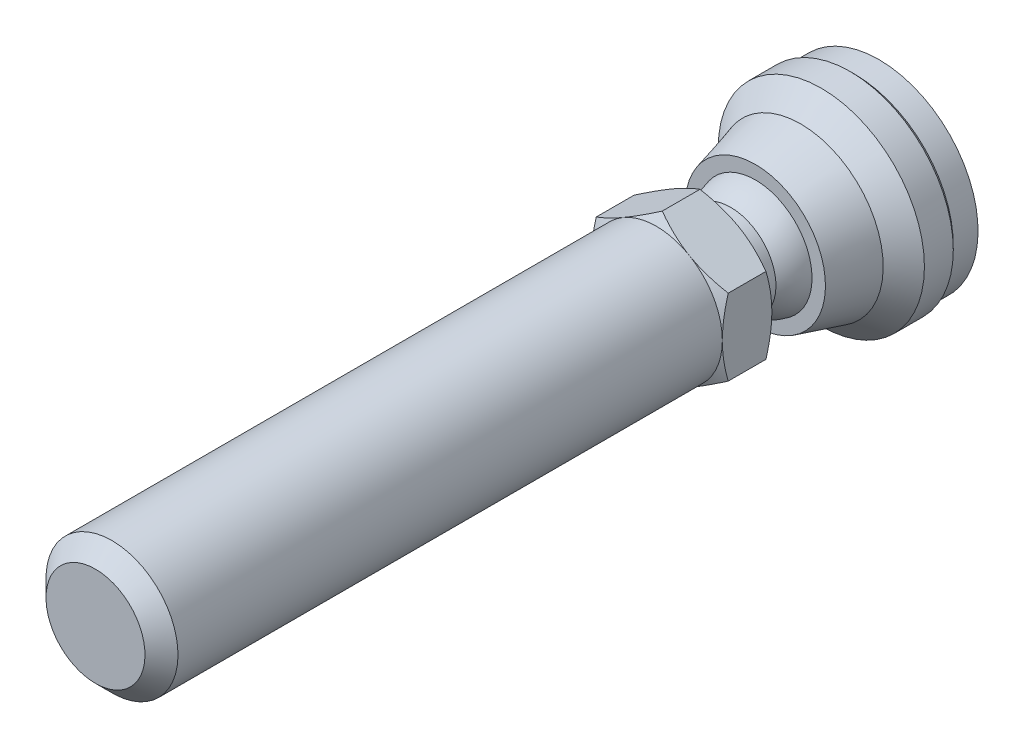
ISO-10303-21;
HEADER;
FILE_DESCRIPTION(('STEP AP214'),'2;1');
FILE_NAME('part.step','',(''),(''),'','','');
FILE_SCHEMA(('AUTOMOTIVE_DESIGN { 1 0 10303 214 1 1 1 1 }'));
ENDSEC;
DATA;
#1=APPLICATION_CONTEXT('core data for automotive mechanical design processes');
#2=APPLICATION_PROTOCOL_DEFINITION('international standard','automotive_design',2000,#1);
#3=PRODUCT_CONTEXT('',#1,'mechanical');
#4=PRODUCT('Part','Part','',(#3));
#5=PRODUCT_RELATED_PRODUCT_CATEGORY('part','',(#4));
#6=PRODUCT_DEFINITION_FORMATION('','',#4);
#7=PRODUCT_DEFINITION_CONTEXT('part definition',#1,'design');
#8=PRODUCT_DEFINITION('design','',#6,#7);
#9=PRODUCT_DEFINITION_SHAPE('','',#8);
#10=(LENGTH_UNIT() NAMED_UNIT(*) SI_UNIT(.MILLI.,.METRE.));
#11=(NAMED_UNIT(*) PLANE_ANGLE_UNIT() SI_UNIT($,.RADIAN.));
#12=(NAMED_UNIT(*) SI_UNIT($,.STERADIAN.) SOLID_ANGLE_UNIT());
#13=UNCERTAINTY_MEASURE_WITH_UNIT(LENGTH_MEASURE(1.E-05),#10,'distance_accuracy_value','');
#14=(GEOMETRIC_REPRESENTATION_CONTEXT(3) GLOBAL_UNCERTAINTY_ASSIGNED_CONTEXT((#13)) GLOBAL_UNIT_ASSIGNED_CONTEXT((#10,
#11,#12)) REPRESENTATION_CONTEXT('',''));
#15=CARTESIAN_POINT('',(0.,0.,0.));
#16=DIRECTION('',(0.,0.,1.));
#17=DIRECTION('',(1.,0.,0.));
#18=AXIS2_PLACEMENT_3D('',#15,#16,#17);
#19=CARTESIAN_POINT('',(-7.76470588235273,0.,21.));
#20=DIRECTION('',(0.,0.,1.));
#21=DIRECTION('',(0.,-1.,0.));
#22=AXIS2_PLACEMENT_3D('',#19,#20,#21);
#23=PLANE('',#22);
#24=CARTESIAN_POINT('',(0.,0.,21.));
#25=DIRECTION('',(0.,0.,-1.));
#26=DIRECTION('',(0.,1.,0.));
#27=AXIS2_PLACEMENT_3D('',#24,#25,#26);
#28=CIRCLE('',#27,5.49999999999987);
#29=CARTESIAN_POINT('',(0.,5.49999999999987,21.));
#30=VERTEX_POINT('',#29);
#31=EDGE_CURVE('E266',#30,#30,#28,.T.);
#32=ORIENTED_EDGE('',*,*,#31,.F.);
#33=EDGE_LOOP('',(#32));
#34=FACE_BOUND('',#33,.T.);
#35=CARTESIAN_POINT('',(0.,0.,21.));
#36=DIRECTION('',(0.,0.,1.));
#37=DIRECTION('',(0.,-1.,0.));
#38=AXIS2_PLACEMENT_3D('',#35,#36,#37);
#39=CIRCLE('',#38,7.99999999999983);
#40=CARTESIAN_POINT('',(-4.,-6.92820323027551,21.));
#41=VERTEX_POINT('',#40);
#42=CARTESIAN_POINT('',(4.,-6.92820323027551,21.));
#43=VERTEX_POINT('',#42);
#44=EDGE_CURVE('E108',#41,#43,#39,.T.);
#45=ORIENTED_EDGE('',*,*,#44,.F.);
#46=CARTESIAN_POINT('',(-8.,0.,21.));
#47=VERTEX_POINT('',#46);
#48=EDGE_CURVE('E117',#47,#41,#39,.T.);
#49=ORIENTED_EDGE('',*,*,#48,.F.);
#50=CARTESIAN_POINT('',(-4.,6.92820323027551,21.));
#51=VERTEX_POINT('',#50);
#52=EDGE_CURVE('E425',#51,#47,#39,.T.);
#53=ORIENTED_EDGE('',*,*,#52,.F.);
#54=CARTESIAN_POINT('',(4.,6.92820323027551,21.));
#55=VERTEX_POINT('',#54);
#56=EDGE_CURVE('E143',#55,#51,#39,.T.);
#57=ORIENTED_EDGE('',*,*,#56,.F.);
#58=CARTESIAN_POINT('',(8.,0.,21.));
#59=VERTEX_POINT('',#58);
#60=EDGE_CURVE('E138',#59,#55,#39,.T.);
#61=ORIENTED_EDGE('',*,*,#60,.F.);
#62=EDGE_CURVE('E119',#43,#59,#39,.T.);
#63=ORIENTED_EDGE('',*,*,#62,.F.);
#64=EDGE_LOOP('',(#45,#49,#53,#57,#61,#63));
#65=FACE_BOUND('',#64,.T.);
#66=ADVANCED_FACE('F14',(#34,#65),#23,.F.);
#67=CARTESIAN_POINT('',(0.,0.,0.));
#68=DIRECTION('',(0.,0.,-1.));
#69=DIRECTION('',(0.,1.,0.));
#70=AXIS2_PLACEMENT_3D('',#67,#68,#69);
#71=CYLINDRICAL_SURFACE('',#70,5.49999999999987);
#72=CARTESIAN_POINT('',(0.,0.,18.));
#73=DIRECTION('',(0.,0.,-1.));
#74=DIRECTION('',(0.,1.,0.));
#75=AXIS2_PLACEMENT_3D('',#72,#73,#74);
#76=CIRCLE('',#75,5.49999999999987);
#77=CARTESIAN_POINT('',(-5.49999999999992,0.,18.));
#78=VERTEX_POINT('',#77);
#79=EDGE_CURVE('E263',#78,#78,#76,.T.);
#80=ORIENTED_EDGE('',*,*,#79,.F.);
#81=EDGE_LOOP('',(#80));
#82=FACE_BOUND('',#81,.T.);
#83=ORIENTED_EDGE('',*,*,#31,.T.);
#84=EDGE_LOOP('',(#83));
#85=FACE_BOUND('',#84,.T.);
#86=ADVANCED_FACE('F331',(#82,#85),#71,.T.);
#87=CARTESIAN_POINT('',(1.2490009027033E-13,0.,13.6698729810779));
#88=DIRECTION('',(0.,0.,-1.));
#89=DIRECTION('',(-1.,0.,0.));
#90=AXIS2_PLACEMENT_3D('',#87,#88,#89);
#91=SPHERICAL_SURFACE('',#90,7.);
#92=CARTESIAN_POINT('',(0.,0.,15.));
#93=DIRECTION('',(0.,0.,-1.));
#94=DIRECTION('',(0.,1.,0.));
#95=AXIS2_PLACEMENT_3D('',#92,#93,#94);
#96=CIRCLE('',#95,6.87246404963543);
#97=CARTESIAN_POINT('',(-6.87246404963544,0.,15.));
#98=VERTEX_POINT('',#97);
#99=EDGE_CURVE('E260',#98,#98,#96,.T.);
#100=CARTESIAN_POINT('',(-6.87246404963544,0.,15.));
#101=CARTESIAN_POINT('',(-6.86587210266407,0.,15.0340591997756));
#102=CARTESIAN_POINT('',(-6.85902692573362,0.,15.0680693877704));
#103=CARTESIAN_POINT('',(-6.84483171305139,0.,15.1359842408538));
#104=CARTESIAN_POINT('',(-6.83748167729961,0.,15.1698889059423));
#105=CARTESIAN_POINT('',(-6.82227834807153,0.,15.2375852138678));
#106=CARTESIAN_POINT('',(-6.81442505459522,0.,15.2713768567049));
#107=CARTESIAN_POINT('',(-6.79821695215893,0.,15.3388396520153));
#108=CARTESIAN_POINT('',(-6.78986214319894,0.,15.3725108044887));
#109=CARTESIAN_POINT('',(-6.77265285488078,0.,15.4397251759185));
#110=CARTESIAN_POINT('',(-6.76379837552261,0.,15.473268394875));
#111=CARTESIAN_POINT('',(-6.7455917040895,0.,15.5402194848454));
#112=CARTESIAN_POINT('',(-6.73623951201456,0.,15.5736273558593));
#113=CARTESIAN_POINT('',(-6.71703948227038,0.,15.6403003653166));
#114=CARTESIAN_POINT('',(-6.70719164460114,0.,15.67356550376));
#115=CARTESIAN_POINT('',(-6.68700250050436,0.,15.7399456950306));
#116=CARTESIAN_POINT('',(-6.67666119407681,0.,15.7730607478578));
#117=CARTESIAN_POINT('',(-6.65548739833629,0.,15.8391334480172));
#118=CARTESIAN_POINT('',(-6.64465490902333,0.,15.8720910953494));
#119=CARTESIAN_POINT('',(-6.62250114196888,0.,15.9378416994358));
#120=CARTESIAN_POINT('',(-6.61117986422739,0.,15.9706346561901));
#121=CARTESIAN_POINT('',(-6.58805102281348,0.,16.0360486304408));
#122=CARTESIAN_POINT('',(-6.57624345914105,0.,16.0686696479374));
#123=CARTESIAN_POINT('',(-6.5521446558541,0.,16.1337325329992));
#124=CARTESIAN_POINT('',(-6.53985341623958,0.,16.1661744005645));
#125=CARTESIAN_POINT('',(-6.51478997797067,0.,16.2308718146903));
#126=CARTESIAN_POINT('',(-6.50201777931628,0.,16.2631273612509));
#127=CARTESIAN_POINT('',(-6.47599524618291,0.,16.3274450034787));
#128=CARTESIAN_POINT('',(-6.46274491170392,0.,16.3595070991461));
#129=CARTESIAN_POINT('',(-6.43576903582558,0.,16.4234307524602));
#130=CARTESIAN_POINT('',(-6.42204349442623,0.,16.455292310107));
#131=CARTESIAN_POINT('',(-6.39412023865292,0.,16.5188078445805));
#132=CARTESIAN_POINT('',(-6.37992252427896,0.,16.5504618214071));
#133=CARTESIAN_POINT('',(-6.35105806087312,0.,16.6135551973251));
#134=CARTESIAN_POINT('',(-6.33639131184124,0.,16.6449945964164));
#135=CARTESIAN_POINT('',(-6.30659202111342,0.,16.7076518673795));
#136=CARTESIAN_POINT('',(-6.29145947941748,0.,16.7388697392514));
#137=CARTESIAN_POINT('',(-6.26073194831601,0.,16.8010770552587));
#138=CARTESIAN_POINT('',(-6.24513695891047,0.,16.8320664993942));
#139=CARTESIAN_POINT('',(-6.21348797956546,0.,16.8938101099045));
#140=CARTESIAN_POINT('',(-6.19743398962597,0.,16.9245642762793));
#141=CARTESIAN_POINT('',(-6.16487055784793,0.,16.9858305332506));
#142=CARTESIAN_POINT('',(-6.14836111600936,0.,17.016342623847));
#143=CARTESIAN_POINT('',(-6.11489042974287,0.,17.0771179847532));
#144=CARTESIAN_POINT('',(-6.09792918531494,0.,17.107381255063));
#145=CARTESIAN_POINT('',(-6.06355864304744,0.,17.1676522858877));
#146=CARTESIAN_POINT('',(-6.04614934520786,0.,17.1976600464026));
#147=CARTESIAN_POINT('',(-6.01088654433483,0.,17.2574134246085));
#148=CARTESIAN_POINT('',(-5.99303304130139,0.,17.2871590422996));
#149=CARTESIAN_POINT('',(-5.9568857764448,0.,17.3463815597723));
#150=CARTESIAN_POINT('',(-5.93859201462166,0.,17.3758584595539));
#151=CARTESIAN_POINT('',(-5.90156827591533,0.,17.4345370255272));
#152=CARTESIAN_POINT('',(-5.88283829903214,0.,17.4637386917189));
#153=CARTESIAN_POINT('',(-5.84494627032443,0.,17.5218603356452));
#154=CARTESIAN_POINT('',(-5.82578421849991,0.,17.5507803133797));
#155=CARTESIAN_POINT('',(-5.78703227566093,0.,17.6083321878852));
#156=CARTESIAN_POINT('',(-5.76744238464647,0.,17.6369640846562));
#157=CARTESIAN_POINT('',(-5.72783909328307,0.,17.6939334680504));
#158=CARTESIAN_POINT('',(-5.70782569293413,0.,17.7222709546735));
#159=CARTESIAN_POINT('',(-5.66737980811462,0.,17.778645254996));
#160=CARTESIAN_POINT('',(-5.64694732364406,0.,17.8066820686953));
#161=CARTESIAN_POINT('',(-5.60566778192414,0.,17.862448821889));
#162=CARTESIAN_POINT('',(-5.58482072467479,0.,17.8901787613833));
#163=CARTESIAN_POINT('',(-5.54271666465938,0.,17.9453256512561));
#164=CARTESIAN_POINT('',(-5.52145966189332,0.,17.9727426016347));
#165=CARTESIAN_POINT('',(-5.49999999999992,0.,18.));
#166=B_SPLINE_CURVE_WITH_KNOTS('',3,(#100,#101,#102,#103,#104,#105,#106,#107,#108,#109,#110,
#111,#112,#113,#114,#115,#116,#117,#118,#119,#120,#121,#122,#123,#124,#125,#126,#127,#128,#129,
#130,#131,#132,#133,#134,#135,#136,#137,#138,#139,#140,#141,#142,#143,#144,#145,#146,#147,#148,
#149,#150,#151,#152,#153,#154,#155,#156,#157,#158,#159,#160,#161,#162,#163,#164,#165),
.UNSPECIFIED.,.F.,.F.,(4,2,2,2,2,2,2,2,2,2,2,2,2,2,2,2,2,2,2,2,2,2,2,2,2,2,2,2,2,2,2,2,4),(0.,
0.104072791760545,0.20814558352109,0.312218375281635,0.41629116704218,0.520363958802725,
0.624436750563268,0.728509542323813,0.83258233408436,0.936655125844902,1.04072791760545,
1.14480070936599,1.24887350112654,1.35294629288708,1.45701908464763,1.56109187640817,
1.66516466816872,1.76923745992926,1.87331025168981,1.97738304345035,2.0814558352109,
2.18552862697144,2.28960141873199,2.39367421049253,2.49774700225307,2.60181979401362,
2.70589258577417,2.80996537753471,2.91403816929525,3.0181109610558,3.12218375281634,
3.22625654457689,3.33032933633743),.UNSPECIFIED.);
#167=EDGE_CURVE('BSEAM337',#98,#78,#166,.T.);
#168=ORIENTED_EDGE('',*,*,#99,.F.);
#169=ORIENTED_EDGE('',*,*,#79,.T.);
#170=ORIENTED_EDGE('',*,*,#167,.T.);
#171=ORIENTED_EDGE('',*,*,#167,.F.);
#172=EDGE_LOOP('',(#168,#170,#169,#171));
#173=FACE_BOUND('',#172,.T.);
#174=ADVANCED_FACE('F337',(#173),#91,.T.);
#175=CARTESIAN_POINT('',(-8.5,0.,15.));
#176=DIRECTION('',(0.,0.,-1.));
#177=DIRECTION('',(0.,1.,0.));
#178=AXIS2_PLACEMENT_3D('',#175,#176,#177);
#179=PLANE('',#178);
#180=CARTESIAN_POINT('',(0.,0.,15.));
#181=DIRECTION('',(0.,0.,-1.));
#182=DIRECTION('',(0.,1.,0.));
#183=AXIS2_PLACEMENT_3D('',#180,#181,#182);
#184=CIRCLE('',#183,8.5);
#185=CARTESIAN_POINT('',(0.,8.5,15.));
#186=VERTEX_POINT('',#185);
#187=EDGE_CURVE('E257',#186,#186,#184,.T.);
#188=ORIENTED_EDGE('',*,*,#187,.F.);
#189=EDGE_LOOP('',(#188));
#190=FACE_BOUND('',#189,.T.);
#191=ORIENTED_EDGE('',*,*,#99,.T.);
#192=EDGE_LOOP('',(#191));
#193=FACE_BOUND('',#192,.T.);
#194=ADVANCED_FACE('F345',(#190,#193),#179,.F.);
#195=CARTESIAN_POINT('',(0.,0.,15.));
#196=DIRECTION('',(0.,0.,-1.));
#197=DIRECTION('',(0.,1.,0.));
#198=AXIS2_PLACEMENT_3D('',#195,#196,#197);
#199=CONICAL_SURFACE('',#198,8.5,0.266252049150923);
#200=CARTESIAN_POINT('',(0.,0.,9.5));
#201=DIRECTION('',(0.,0.,-1.));
#202=DIRECTION('',(0.,1.,0.));
#203=AXIS2_PLACEMENT_3D('',#200,#201,#202);
#204=CIRCLE('',#203,10.);
#205=CARTESIAN_POINT('',(0.,10.,9.5));
#206=VERTEX_POINT('',#205);
#207=EDGE_CURVE('E254',#206,#206,#204,.T.);
#208=ORIENTED_EDGE('',*,*,#207,.F.);
#209=EDGE_LOOP('',(#208));
#210=FACE_BOUND('',#209,.T.);
#211=ORIENTED_EDGE('',*,*,#187,.T.);
#212=EDGE_LOOP('',(#211));
#213=FACE_BOUND('',#212,.T.);
#214=ADVANCED_FACE('F352',(#210,#213),#199,.T.);
#215=CARTESIAN_POINT('',(0.,0.,9.5));
#216=DIRECTION('',(0.,0.,-1.));
#217=DIRECTION('',(0.,1.,0.));
#218=AXIS2_PLACEMENT_3D('',#215,#216,#217);
#219=CONICAL_SURFACE('',#218,10.,0.785398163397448);
#220=CARTESIAN_POINT('',(0.,0.,7.));
#221=DIRECTION('',(0.,0.,-1.));
#222=DIRECTION('',(0.,1.,0.));
#223=AXIS2_PLACEMENT_3D('',#220,#221,#222);
#224=CIRCLE('',#223,12.5);
#225=CARTESIAN_POINT('',(0.,12.5,7.));
#226=VERTEX_POINT('',#225);
#227=EDGE_CURVE('E251',#226,#226,#224,.T.);
#228=ORIENTED_EDGE('',*,*,#227,.F.);
#229=EDGE_LOOP('',(#228));
#230=FACE_BOUND('',#229,.T.);
#231=ORIENTED_EDGE('',*,*,#207,.T.);
#232=EDGE_LOOP('',(#231));
#233=FACE_BOUND('',#232,.T.);
#234=ADVANCED_FACE('F356',(#230,#233),#219,.T.);
#235=CARTESIAN_POINT('',(0.,0.,0.));
#236=DIRECTION('',(0.,0.,-1.));
#237=DIRECTION('',(0.,1.,0.));
#238=AXIS2_PLACEMENT_3D('',#235,#236,#237);
#239=CYLINDRICAL_SURFACE('',#238,12.5);
#240=CARTESIAN_POINT('',(0.,0.,3.5));
#241=DIRECTION('',(0.,0.,-1.));
#242=DIRECTION('',(0.,1.,0.));
#243=AXIS2_PLACEMENT_3D('',#240,#241,#242);
#244=CIRCLE('',#243,12.5);
#245=CARTESIAN_POINT('',(0.,12.5,3.5));
#246=VERTEX_POINT('',#245);
#247=EDGE_CURVE('E248',#246,#246,#244,.T.);
#248=ORIENTED_EDGE('',*,*,#247,.F.);
#249=EDGE_LOOP('',(#248));
#250=FACE_BOUND('',#249,.T.);
#251=ORIENTED_EDGE('',*,*,#227,.T.);
#252=EDGE_LOOP('',(#251));
#253=FACE_BOUND('',#252,.T.);
#254=ADVANCED_FACE('F360',(#250,#253),#239,.T.);
#255=CARTESIAN_POINT('',(0.,0.,3.5));
#256=DIRECTION('',(0.,0.,1.));
#257=DIRECTION('',(0.,-1.,0.));
#258=AXIS2_PLACEMENT_3D('',#255,#256,#257);
#259=CONICAL_SURFACE('',#258,12.5,0.785398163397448);
#260=CARTESIAN_POINT('',(0.,0.,3.));
#261=DIRECTION('',(0.,0.,-1.));
#262=DIRECTION('',(0.,1.,0.));
#263=AXIS2_PLACEMENT_3D('',#260,#261,#262);
#264=CIRCLE('',#263,12.);
#265=CARTESIAN_POINT('',(0.,12.,3.));
#266=VERTEX_POINT('',#265);
#267=EDGE_CURVE('E245',#266,#266,#264,.T.);
#268=ORIENTED_EDGE('',*,*,#267,.F.);
#269=EDGE_LOOP('',(#268));
#270=FACE_BOUND('',#269,.T.);
#271=ORIENTED_EDGE('',*,*,#247,.T.);
#272=EDGE_LOOP('',(#271));
#273=FACE_BOUND('',#272,.T.);
#274=ADVANCED_FACE('F364',(#270,#273),#259,.T.);
#275=CARTESIAN_POINT('',(0.,0.,0.));
#276=DIRECTION('',(0.,0.,-1.));
#277=DIRECTION('',(0.,1.,0.));
#278=AXIS2_PLACEMENT_3D('',#275,#276,#277);
#279=CYLINDRICAL_SURFACE('',#278,12.);
#280=CARTESIAN_POINT('',(0.,0.,0.));
#281=DIRECTION('',(0.,0.,-1.));
#282=DIRECTION('',(0.,1.,0.));
#283=AXIS2_PLACEMENT_3D('',#280,#281,#282);
#284=CIRCLE('',#283,12.);
#285=CARTESIAN_POINT('',(0.,12.,0.));
#286=VERTEX_POINT('',#285);
#287=EDGE_CURVE('E242',#286,#286,#284,.T.);
#288=ORIENTED_EDGE('',*,*,#287,.F.);
#289=EDGE_LOOP('',(#288));
#290=FACE_BOUND('',#289,.T.);
#291=ORIENTED_EDGE('',*,*,#267,.T.);
#292=EDGE_LOOP('',(#291));
#293=FACE_BOUND('',#292,.T.);
#294=ADVANCED_FACE('F368',(#290,#293),#279,.T.);
#295=CARTESIAN_POINT('',(-12.,0.,0.));
#296=DIRECTION('',(0.,0.,1.));
#297=DIRECTION('',(0.,-1.,0.));
#298=AXIS2_PLACEMENT_3D('',#295,#296,#297);
#299=PLANE('',#298);
#300=ORIENTED_EDGE('',*,*,#287,.T.);
#301=EDGE_LOOP('',(#300));
#302=FACE_BOUND('',#301,.T.);
#303=ADVANCED_FACE('F164',(#302),#299,.F.);
#304=CARTESIAN_POINT('',(0.,0.,21.));
#305=DIRECTION('',(0.,0.,1.));
#306=DIRECTION('',(0.,-1.,0.));
#307=AXIS2_PLACEMENT_3D('',#304,#305,#306);
#308=CONICAL_SURFACE('',#307,7.99999999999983,1.0471975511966);
#309=CARTESIAN_POINT('',(-8.,12.4061400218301,24.9039577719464));
#310=CARTESIAN_POINT('',(-8.,12.0567390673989,24.7344691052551));
#311=CARTESIAN_POINT('',(-8.,11.7065360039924,24.5666056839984));
#312=CARTESIAN_POINT('',(-8.,11.0040990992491,24.2350433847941));
#313=CARTESIAN_POINT('',(-8.,10.6518649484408,24.0713451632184));
#314=CARTESIAN_POINT('',(-8.,9.94312417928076,23.7482036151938));
#315=CARTESIAN_POINT('',(-8.,9.58660474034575,23.5887883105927));
#316=CARTESIAN_POINT('',(-8.,8.87073019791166,23.2764819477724));
#317=CARTESIAN_POINT('',(-8.,8.51137522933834,23.1235905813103));
#318=CARTESIAN_POINT('',(-8.,7.77764523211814,22.821269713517));
#319=CARTESIAN_POINT('',(-8.,7.40315866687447,22.6721094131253));
#320=CARTESIAN_POINT('',(-8.,6.64980495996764,22.3850790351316));
#321=CARTESIAN_POINT('',(-8.,6.27093733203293,22.2472102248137));
#322=CARTESIAN_POINT('',(-8.,5.50892351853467,21.9863830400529));
#323=CARTESIAN_POINT('',(-8.,5.12578777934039,21.8633944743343));
#324=CARTESIAN_POINT('',(-8.,4.35403405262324,21.6362730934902));
#325=CARTESIAN_POINT('',(-8.,3.96541783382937,21.5321343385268));
#326=CARTESIAN_POINT('',(-8.,3.18458325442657,21.3482734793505));
#327=CARTESIAN_POINT('',(-8.,2.79239704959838,21.2684185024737));
#328=CARTESIAN_POINT('',(-8.,2.20054666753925,21.1703042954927));
#329=CARTESIAN_POINT('',(-8.,2.00265345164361,21.1412096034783));
#330=CARTESIAN_POINT('',(-8.,1.60588355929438,21.0908136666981));
#331=CARTESIAN_POINT('',(-8.,1.40700697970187,21.0695116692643));
#332=CARTESIAN_POINT('',(-8.,1.01113431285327,21.0353926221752));
#333=CARTESIAN_POINT('',(-8.,0.814147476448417,21.0224686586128));
#334=CARTESIAN_POINT('',(-8.,0.419803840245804,21.0049623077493));
#335=CARTESIAN_POINT('',(-8.,0.222447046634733,21.0003797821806));
#336=CARTESIAN_POINT('',(-8.,-0.172283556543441,20.9996656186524));
#337=CARTESIAN_POINT('',(-8.,-0.369657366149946,21.0035340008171));
#338=CARTESIAN_POINT('',(-8.,-0.76406652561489,21.0196271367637));
#339=CARTESIAN_POINT('',(-8.,-0.961101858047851,21.0318523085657));
#340=CARTESIAN_POINT('',(-8.,-1.43466444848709,21.0710189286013));
#341=CARTESIAN_POINT('',(-8.,-1.7108705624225,21.1019269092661));
#342=CARTESIAN_POINT('',(-8.,-2.26121936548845,21.1784780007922));
#343=CARTESIAN_POINT('',(-8.,-2.53536176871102,21.2241231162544));
#344=CARTESIAN_POINT('',(-8.,-3.35438848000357,21.3807426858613));
#345=CARTESIAN_POINT('',(-8.,-3.89556315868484,21.5113724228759));
#346=CARTESIAN_POINT('',(-8.,-4.70473632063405,21.7377258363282));
#347=CARTESIAN_POINT('',(-8.,-4.97693663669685,21.8192912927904));
#348=CARTESIAN_POINT('',(-8.,-5.51869333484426,21.9908530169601));
#349=CARTESIAN_POINT('',(-8.,-5.78824969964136,22.0808493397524));
#350=CARTESIAN_POINT('',(-8.,-6.32480378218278,22.2678322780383));
#351=CARTESIAN_POINT('',(-8.,-6.59180232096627,22.3648165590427));
#352=CARTESIAN_POINT('',(-8.,-7.1235902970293,22.5646384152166));
#353=CARTESIAN_POINT('',(-8.,-7.38837975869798,22.6674759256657));
#354=CARTESIAN_POINT('',(-8.,-8.00704478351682,22.9143675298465));
#355=CARTESIAN_POINT('',(-8.,-8.3601299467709,23.0603983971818));
#356=CARTESIAN_POINT('',(-8.,-9.06334032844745,23.3594411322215));
#357=CARTESIAN_POINT('',(-8.,-9.41346537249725,23.5124534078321));
#358=CARTESIAN_POINT('',(-8.,-10.1112979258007,23.8240789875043));
#359=CARTESIAN_POINT('',(-8.,-10.4590048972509,23.9826934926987));
#360=CARTESIAN_POINT('',(-8.,-11.1523236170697,24.304408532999));
#361=CARTESIAN_POINT('',(-8.,-11.4979354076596,24.4675089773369));
#362=CARTESIAN_POINT('',(-8.,-12.1877737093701,24.7975412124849));
#363=CARTESIAN_POINT('',(-8.,-12.5319983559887,24.9644768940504));
#364=CARTESIAN_POINT('',(-8.,-13.2189678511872,25.3013685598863));
#365=CARTESIAN_POINT('',(-8.,-13.5617126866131,25.471324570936));
#366=CARTESIAN_POINT('',(-8.,-14.5879884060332,25.9848848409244));
#367=CARTESIAN_POINT('',(-8.,-15.2696498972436,26.3322244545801));
#368=CARTESIAN_POINT('',(-8.,-16.5732624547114,27.0049968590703));
#369=CARTESIAN_POINT('',(-8.,-17.1955016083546,27.329873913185));
#370=CARTESIAN_POINT('',(-8.,-18.437648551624,27.984102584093));
#371=CARTESIAN_POINT('',(-7.99999999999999,-19.0575562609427,28.3134543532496));
#372=CARTESIAN_POINT('',(-7.99999999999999,-20.2940347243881,28.9747625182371));
#373=CARTESIAN_POINT('',(-7.99999999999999,-20.9106099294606,29.3067106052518));
#374=CARTESIAN_POINT('',(-7.99999999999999,-22.1422657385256,29.9732899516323));
#375=CARTESIAN_POINT('',(-8.,-22.7573464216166,30.3079210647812));
#376=CARTESIAN_POINT('',(-8.,-23.3718752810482,30.6435556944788));
#377=B_SPLINE_CURVE_WITH_KNOTS('',3,(#309,#310,#311,#312,#313,#314,#315,#316,#317,#318,#319,
#320,#321,#322,#323,#324,#325,#326,#327,#328,#329,#330,#331,#332,#333,#334,#335,#336,#337,#338,
#339,#340,#341,#342,#343,#344,#345,#346,#347,#348,#349,#350,#351,#352,#353,#354,#355,#356,#357,
#358,#359,#360,#361,#362,#363,#364,#365,#366,#367,#368,#369,#370,#371,#372,#373,#374,#375,#376),
.UNSPECIFIED.,.F.,.F.,(4,2,2,2,2,2,2,2,2,2,2,2,2,2,2,2,2,2,2,2,2,2,2,2,2,2,2,2,2,2,2,2,2,4),(0.,
1.16503221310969,2.33024689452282,3.50180628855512,4.67331026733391,5.88246664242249,
7.09175853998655,8.29855416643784,9.504968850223,10.7046584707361,11.3045908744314,
11.9044653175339,12.4965255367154,13.0885759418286,13.6806277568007,14.2727091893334,
15.1060284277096,15.939461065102,17.607253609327,18.4596578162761,19.3120675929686,
20.1641939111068,21.0163108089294,22.162485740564,23.308727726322,24.4552169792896,
25.6016830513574,26.7493685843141,27.8970642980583,30.1921580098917,32.2979733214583,
34.4038605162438,36.5046129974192,38.6052517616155),.UNSPECIFIED.);
#378=CARTESIAN_POINT('',(-8.,-4.61880215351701,21.7145311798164));
#379=VERTEX_POINT('',#378);
#380=EDGE_CURVE('E17',#47,#379,#377,.T.);
#381=ORIENTED_EDGE('',*,*,#380,.F.);
#382=ORIENTED_EDGE('',*,*,#48,.T.);
#383=CARTESIAN_POINT('',(-8.0002,-4.61868668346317,21.714597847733));
#384=CARTESIAN_POINT('',(-7.8243512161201,-4.7202130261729,21.6559907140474));
#385=CARTESIAN_POINT('',(-7.64784680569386,-4.82211789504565,21.6000434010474));
#386=CARTESIAN_POINT('',(-7.29340453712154,-5.02675523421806,21.4942010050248));
#387=CARTESIAN_POINT('',(-7.11546609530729,-5.1294880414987,21.4443085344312));
#388=CARTESIAN_POINT('',(-6.57880176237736,-5.43933133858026,21.304692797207));
#389=CARTESIAN_POINT('',(-6.21795741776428,-5.64766491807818,21.2252811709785));
#390=CARTESIAN_POINT('',(-5.67796082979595,-5.95943209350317,21.1321616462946));
#391=CARTESIAN_POINT('',(-5.50042181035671,-6.06193429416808,21.1056345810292));
#392=CARTESIAN_POINT('',(-5.1445408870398,-6.26740224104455,21.061153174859));
#393=CARTESIAN_POINT('',(-4.96619905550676,-6.37036794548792,21.0431980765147));
#394=CARTESIAN_POINT('',(-4.60920831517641,-6.57647664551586,21.016315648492));
#395=CARTESIAN_POINT('',(-4.4305599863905,-6.67961930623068,21.0073780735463));
#396=CARTESIAN_POINT('',(-4.07309829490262,-6.88599991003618,20.9987223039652));
#397=CARTESIAN_POINT('',(-3.89428493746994,-6.98923785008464,20.9990038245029));
#398=CARTESIAN_POINT('',(-3.5599866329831,-7.18224506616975,21.0081450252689));
#399=CARTESIAN_POINT('',(-3.40447809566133,-7.27202796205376,21.0158896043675));
#400=CARTESIAN_POINT('',(-3.09382523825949,-7.45138347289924,21.0382011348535));
#401=CARTESIAN_POINT('',(-2.93868094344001,-7.5409560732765,21.0527685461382));
#402=CARTESIAN_POINT('',(-2.47384868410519,-7.80932710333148,21.1063606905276));
#403=CARTESIAN_POINT('',(-2.16498351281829,-7.98765049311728,21.1552686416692));
#404=CARTESIAN_POINT('',(-1.54397677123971,-8.34618890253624,21.2775394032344));
#405=CARTESIAN_POINT('',(-1.23191445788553,-8.52635816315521,21.3514205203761));
#406=CARTESIAN_POINT('',(-0.612443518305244,-8.88400987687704,21.5191001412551));
#407=CARTESIAN_POINT('',(-0.30502695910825,-9.06149691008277,21.6128592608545));
#408=CARTESIAN_POINT('',(0.000200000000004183,-9.23771977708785,21.714597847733));
#409=B_SPLINE_CURVE_WITH_KNOTS('',3,(#383,#384,#385,#386,#387,#388,#389,#390,#391,#392,#393,
#394,#395,#396,#397,#398,#399,#400,#401,#402,#403,#404,#405,#406,#407,#408),.UNSPECIFIED.,.F.,
.F.,(4,2,2,2,2,2,2,2,2,2,2,2,4),(0.,0.633973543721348,1.26821965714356,2.53934712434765,
3.15934343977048,3.77928496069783,4.39852133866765,5.01773858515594,5.55680239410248,
6.09590254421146,7.17487077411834,8.27776850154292,9.37850115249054),.UNSPECIFIED.);
#410=EDGE_CURVE('E34',#379,#41,#409,.T.);
#411=ORIENTED_EDGE('',*,*,#410,.F.);
#412=EDGE_LOOP('',(#381,#382,#411));
#413=FACE_BOUND('',#412,.T.);
#414=ADVANCED_FACE('F159',(#413),#308,.T.);
#415=ORIENTED_EDGE('',*,*,#52,.T.);
#416=CARTESIAN_POINT('',(-8.,4.618802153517,21.7145311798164));
#417=VERTEX_POINT('',#416);
#418=EDGE_CURVE('E9',#417,#47,#377,.T.);
#419=ORIENTED_EDGE('',*,*,#418,.F.);
#420=CARTESIAN_POINT('',(0.000200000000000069,9.23771977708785,21.714597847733));
#421=CARTESIAN_POINT('',(-0.175648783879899,9.13619343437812,21.6559907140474));
#422=CARTESIAN_POINT('',(-0.352153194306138,9.03428856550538,21.6000434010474));
#423=CARTESIAN_POINT('',(-0.706595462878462,8.82965122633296,21.4942010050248));
#424=CARTESIAN_POINT('',(-0.884533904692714,8.72691841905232,21.4443085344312));
#425=CARTESIAN_POINT('',(-1.42119823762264,8.41707512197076,21.304692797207));
#426=CARTESIAN_POINT('',(-1.78204258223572,8.20874154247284,21.2252811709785));
#427=CARTESIAN_POINT('',(-2.32203917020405,7.89697436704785,21.1321616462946));
#428=CARTESIAN_POINT('',(-2.49957818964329,7.79447216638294,21.1056345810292));
#429=CARTESIAN_POINT('',(-2.8554591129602,7.58900421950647,21.061153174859));
#430=CARTESIAN_POINT('',(-3.03380094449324,7.4860385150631,21.0431980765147));
#431=CARTESIAN_POINT('',(-3.39079168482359,7.27992981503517,21.016315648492));
#432=CARTESIAN_POINT('',(-3.5694400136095,7.17678715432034,21.0073780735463));
#433=CARTESIAN_POINT('',(-3.92690170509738,6.97040655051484,20.9987223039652));
#434=CARTESIAN_POINT('',(-4.10571506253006,6.86716861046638,20.9990038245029));
#435=CARTESIAN_POINT('',(-4.4400133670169,6.67416139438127,21.0081450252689));
#436=CARTESIAN_POINT('',(-4.59552190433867,6.58437849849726,21.0158896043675));
#437=CARTESIAN_POINT('',(-4.90617476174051,6.40502298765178,21.0382011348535));
#438=CARTESIAN_POINT('',(-5.06131905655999,6.31545038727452,21.0527685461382));
#439=CARTESIAN_POINT('',(-5.52615131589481,6.04707935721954,21.1063606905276));
#440=CARTESIAN_POINT('',(-5.83501648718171,5.86875596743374,21.1552686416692));
#441=CARTESIAN_POINT('',(-6.4560232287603,5.51021755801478,21.2775394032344));
#442=CARTESIAN_POINT('',(-6.76808554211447,5.33004829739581,21.3514205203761));
#443=CARTESIAN_POINT('',(-7.38755648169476,4.97239658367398,21.5191001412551));
#444=CARTESIAN_POINT('',(-7.69497304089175,4.79490955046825,21.6128592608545));
#445=CARTESIAN_POINT('',(-8.0002,4.61868668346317,21.714597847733));
#446=B_SPLINE_CURVE_WITH_KNOTS('',3,(#420,#421,#422,#423,#424,#425,#426,#427,#428,#429,#430,
#431,#432,#433,#434,#435,#436,#437,#438,#439,#440,#441,#442,#443,#444,#445),.UNSPECIFIED.,.F.,
.F.,(4,2,2,2,2,2,2,2,2,2,2,2,4),(0.,0.633973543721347,1.26821965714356,2.53934712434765,
3.15934343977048,3.77928496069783,4.39852133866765,5.01773858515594,5.55680239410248,
6.09590254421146,7.17487077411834,8.27776850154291,9.37850115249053),.UNSPECIFIED.);
#447=EDGE_CURVE('E139',#51,#417,#446,.T.);
#448=ORIENTED_EDGE('',*,*,#447,.F.);
#449=EDGE_LOOP('',(#415,#419,#448));
#450=FACE_BOUND('',#449,.T.);
#451=ADVANCED_FACE('F163',(#450),#308,.T.);
#452=ORIENTED_EDGE('',*,*,#56,.T.);
#453=CARTESIAN_POINT('',(0.,9.23760430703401,21.7145311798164));
#454=VERTEX_POINT('',#453);
#455=EDGE_CURVE('E141',#454,#51,#446,.T.);
#456=ORIENTED_EDGE('',*,*,#455,.F.);
#457=CARTESIAN_POINT('',(8.0002,4.61868668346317,21.714597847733));
#458=CARTESIAN_POINT('',(7.8243512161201,4.7202130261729,21.6559907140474));
#459=CARTESIAN_POINT('',(7.64784680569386,4.82211789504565,21.6000434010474));
#460=CARTESIAN_POINT('',(7.29340453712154,5.02675523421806,21.4942010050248));
#461=CARTESIAN_POINT('',(7.11546609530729,5.1294880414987,21.4443085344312));
#462=CARTESIAN_POINT('',(6.57880176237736,5.43933133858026,21.304692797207));
#463=CARTESIAN_POINT('',(6.21795741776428,5.64766491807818,21.2252811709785));
#464=CARTESIAN_POINT('',(5.67796082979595,5.95943209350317,21.1321616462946));
#465=CARTESIAN_POINT('',(5.50042181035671,6.06193429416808,21.1056345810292));
#466=CARTESIAN_POINT('',(5.1445408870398,6.26740224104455,21.061153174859));
#467=CARTESIAN_POINT('',(4.96619905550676,6.37036794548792,21.0431980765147));
#468=CARTESIAN_POINT('',(4.60920831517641,6.57647664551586,21.016315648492));
#469=CARTESIAN_POINT('',(4.4305599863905,6.67961930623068,21.0073780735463));
#470=CARTESIAN_POINT('',(4.07309829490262,6.88599991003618,20.9987223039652));
#471=CARTESIAN_POINT('',(3.89428493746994,6.98923785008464,20.9990038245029));
#472=CARTESIAN_POINT('',(3.5599866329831,7.18224506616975,21.0081450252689));
#473=CARTESIAN_POINT('',(3.40447809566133,7.27202796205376,21.0158896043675));
#474=CARTESIAN_POINT('',(3.09382523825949,7.45138347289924,21.0382011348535));
#475=CARTESIAN_POINT('',(2.93868094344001,7.5409560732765,21.0527685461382));
#476=CARTESIAN_POINT('',(2.47384868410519,7.80932710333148,21.1063606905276));
#477=CARTESIAN_POINT('',(2.16498351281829,7.98765049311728,21.1552686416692));
#478=CARTESIAN_POINT('',(1.54397677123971,8.34618890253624,21.2775394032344));
#479=CARTESIAN_POINT('',(1.23191445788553,8.52635816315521,21.3514205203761));
#480=CARTESIAN_POINT('',(0.612443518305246,8.88400987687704,21.5191001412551));
#481=CARTESIAN_POINT('',(0.305026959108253,9.06149691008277,21.6128592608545));
#482=CARTESIAN_POINT('',(-0.000199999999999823,9.23771977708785,21.714597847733));
#483=B_SPLINE_CURVE_WITH_KNOTS('',3,(#457,#458,#459,#460,#461,#462,#463,#464,#465,#466,#467,
#468,#469,#470,#471,#472,#473,#474,#475,#476,#477,#478,#479,#480,#481,#482),.UNSPECIFIED.,.F.,
.F.,(4,2,2,2,2,2,2,2,2,2,2,2,4),(0.,0.633973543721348,1.26821965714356,2.53934712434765,
3.15934343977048,3.77928496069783,4.39852133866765,5.01773858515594,5.55680239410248,
6.09590254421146,7.17487077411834,8.27776850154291,9.37850115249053),.UNSPECIFIED.);
#484=EDGE_CURVE('E150',#55,#454,#483,.T.);
#485=ORIENTED_EDGE('',*,*,#484,.F.);
#486=EDGE_LOOP('',(#452,#456,#485));
#487=FACE_BOUND('',#486,.T.);
#488=ADVANCED_FACE('F428',(#487),#308,.T.);
#489=ORIENTED_EDGE('',*,*,#60,.T.);
#490=CARTESIAN_POINT('',(8.,4.61880215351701,21.7145311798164));
#491=VERTEX_POINT('',#490);
#492=EDGE_CURVE('E439',#491,#55,#483,.T.);
#493=ORIENTED_EDGE('',*,*,#492,.F.);
#494=CARTESIAN_POINT('',(8.,12.4061400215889,24.9039577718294));
#495=CARTESIAN_POINT('',(8.,12.0567390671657,24.734469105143));
#496=CARTESIAN_POINT('',(8.,11.7065360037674,24.5666056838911));
#497=CARTESIAN_POINT('',(8.,11.0040990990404,24.2350433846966));
#498=CARTESIAN_POINT('',(8.,10.6518649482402,24.0713451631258));
#499=CARTESIAN_POINT('',(8.,9.94312417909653,23.748203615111));
#500=CARTESIAN_POINT('',(8.,9.58660474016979,23.5887883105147));
#501=CARTESIAN_POINT('',(8.,8.87073019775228,23.2764819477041));
#502=CARTESIAN_POINT('',(8.,8.51137522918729,23.1235905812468));
#503=CARTESIAN_POINT('',(8.,7.77764523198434,22.8212697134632));
#504=CARTESIAN_POINT('',(8.,7.40315866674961,22.6721094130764));
#505=CARTESIAN_POINT('',(8.,6.64980495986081,22.3850790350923));
#506=CARTESIAN_POINT('',(8.,6.27093733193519,22.247210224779));
#507=CARTESIAN_POINT('',(8.,5.50892351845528,21.986383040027));
#508=CARTESIAN_POINT('',(8.,5.12578777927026,21.8633944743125));
#509=CARTESIAN_POINT('',(8.,4.35403405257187,21.6362730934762));
#510=CARTESIAN_POINT('',(8.,3.9654178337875,21.5321343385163));
#511=CARTESIAN_POINT('',(8.,3.18458325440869,21.3482734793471));
#512=CARTESIAN_POINT('',(8.,2.79239704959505,21.2684185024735));
#513=CARTESIAN_POINT('',(8.,2.20054666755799,21.1703042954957));
#514=CARTESIAN_POINT('',(8.,2.00265345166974,21.1412096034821));
#515=CARTESIAN_POINT('',(8.,1.60588355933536,21.0908136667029));
#516=CARTESIAN_POINT('',(8.,1.40700697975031,21.0695116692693));
#517=CARTESIAN_POINT('',(8.,1.01113431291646,21.0353926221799));
#518=CARTESIAN_POINT('',(8.,0.814147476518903,21.022468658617));
#519=CARTESIAN_POINT('',(8.,0.41980384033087,21.004962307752));
#520=CARTESIAN_POINT('',(8.,0.222447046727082,21.0003797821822));
#521=CARTESIAN_POINT('',(8.,-0.172283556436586,20.9996656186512));
#522=CARTESIAN_POINT('',(8.,-0.369657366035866,21.0035340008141));
#523=CARTESIAN_POINT('',(8.,-0.764066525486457,21.0196271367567));
#524=CARTESIAN_POINT('',(8.,-0.96110185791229,21.0318523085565));
#525=CARTESIAN_POINT('',(8.,-1.43466444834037,21.0710189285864));
#526=CARTESIAN_POINT('',(8.,-1.71087056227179,21.1019269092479));
#527=CARTESIAN_POINT('',(8.,-2.26121936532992,21.1784780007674));
#528=CARTESIAN_POINT('',(8.,-2.53536176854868,21.2241231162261));
#529=CARTESIAN_POINT('',(8.,-3.35438847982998,21.3807426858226));
#530=CARTESIAN_POINT('',(8.,-3.89556315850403,21.5113724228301));
#531=CARTESIAN_POINT('',(8.,-4.70473632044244,21.7377258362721));
#532=CARTESIAN_POINT('',(8.,-4.97693663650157,21.8192912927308));
#533=CARTESIAN_POINT('',(8.,-5.51869333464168,21.9908530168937));
#534=CARTESIAN_POINT('',(8.,-5.78824969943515,22.0808493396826));
#535=CARTESIAN_POINT('',(8.,-6.32480378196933,22.2678322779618));
#536=CARTESIAN_POINT('',(8.,-6.59180232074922,22.3648165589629));
#537=CARTESIAN_POINT('',(8.,-7.12359029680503,22.5646384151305));
#538=CARTESIAN_POINT('',(8.,-7.3883797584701,22.6674759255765));
#539=CARTESIAN_POINT('',(8.,-8.00704478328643,22.9143675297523));
#540=CARTESIAN_POINT('',(8.,-8.36012994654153,23.0603983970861));
#541=CARTESIAN_POINT('',(8.,-9.06334032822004,23.359441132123));
#542=CARTESIAN_POINT('',(8.,-9.41346537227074,23.5124534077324));
#543=CARTESIAN_POINT('',(8.,-10.1112979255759,23.8240789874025));
#544=CARTESIAN_POINT('',(8.,-10.459004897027,23.9826934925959));
#545=CARTESIAN_POINT('',(8.,-11.1523236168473,24.3044085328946));
#546=CARTESIAN_POINT('',(8.,-11.4979354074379,24.4675089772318));
#547=CARTESIAN_POINT('',(8.,-12.1877737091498,24.7975412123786));
#548=CARTESIAN_POINT('',(8.,-12.5319983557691,24.9644768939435));
#549=CARTESIAN_POINT('',(8.,-13.218967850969,25.3013685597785));
#550=CARTESIAN_POINT('',(8.,-13.5617126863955,25.4713245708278));
#551=CARTESIAN_POINT('',(8.,-14.5879884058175,25.9848848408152));
#552=CARTESIAN_POINT('',(8.,-15.269649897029,26.3322244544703));
#553=CARTESIAN_POINT('',(8.,-16.5732624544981,27.0049968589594));
#554=CARTESIAN_POINT('',(8.,-17.1955016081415,27.3298739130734));
#555=CARTESIAN_POINT('',(8.,-18.4376485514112,27.9841025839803));
#556=CARTESIAN_POINT('',(8.,-19.05755626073,28.3134543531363));
#557=CARTESIAN_POINT('',(8.,-20.2940347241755,28.9747625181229));
#558=CARTESIAN_POINT('',(8.,-20.9106099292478,29.306710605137));
#559=CARTESIAN_POINT('',(8.,-22.1422657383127,29.9732899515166));
#560=CARTESIAN_POINT('',(8.,-22.7573464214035,30.3079210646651));
#561=CARTESIAN_POINT('',(8.,-23.3718752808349,30.6435556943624));
#562=B_SPLINE_CURVE_WITH_KNOTS('',3,(#494,#495,#496,#497,#498,#499,#500,#501,#502,#503,#504,
#505,#506,#507,#508,#509,#510,#511,#512,#513,#514,#515,#516,#517,#518,#519,#520,#521,#522,#523,
#524,#525,#526,#527,#528,#529,#530,#531,#532,#533,#534,#535,#536,#537,#538,#539,#540,#541,#542,
#543,#544,#545,#546,#547,#548,#549,#550,#551,#552,#553,#554,#555,#556,#557,#558,#559,#560,#561),
.UNSPECIFIED.,.F.,.F.,(4,2,2,2,2,2,2,2,2,2,2,2,2,2,2,2,2,2,2,2,2,2,2,2,2,2,2,2,2,2,2,2,2,4),(0.,
1.16503221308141,2.33024689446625,3.50180628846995,4.67331026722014,5.88246664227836,
7.09175853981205,8.29855416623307,9.50496884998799,10.7046584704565,11.3045908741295,
11.9044653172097,12.4965255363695,13.088575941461,13.6806277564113,14.2727091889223,
15.1060284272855,15.9394610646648,17.6072536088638,18.4596578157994,19.3120675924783,
20.164193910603,21.0163108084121,22.1624857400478,23.3087277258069,24.4552169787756,
25.6016830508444,26.7493685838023,27.8970642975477,30.1921580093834,32.2979733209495,
34.4038605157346,36.5046129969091,38.6052517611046),.UNSPECIFIED.);
#563=EDGE_CURVE('E173',#59,#491,#562,.F.);
#564=ORIENTED_EDGE('',*,*,#563,.F.);
#565=EDGE_LOOP('',(#489,#493,#564));
#566=FACE_BOUND('',#565,.T.);
#567=ADVANCED_FACE('F433',(#566),#308,.T.);
#568=ORIENTED_EDGE('',*,*,#62,.T.);
#569=CARTESIAN_POINT('',(8.,-4.61880215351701,21.7145311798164));
#570=VERTEX_POINT('',#569);
#571=EDGE_CURVE('E126',#570,#59,#562,.F.);
#572=ORIENTED_EDGE('',*,*,#571,.F.);
#573=CARTESIAN_POINT('',(-0.00019999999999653,-9.23771977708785,21.714597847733));
#574=CARTESIAN_POINT('',(0.175648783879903,-9.13619343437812,21.6559907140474));
#575=CARTESIAN_POINT('',(0.352153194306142,-9.03428856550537,21.6000434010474));
#576=CARTESIAN_POINT('',(0.706595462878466,-8.82965122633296,21.4942010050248));
#577=CARTESIAN_POINT('',(0.884533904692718,-8.72691841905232,21.4443085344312));
#578=CARTESIAN_POINT('',(1.42119823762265,-8.41707512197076,21.304692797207));
#579=CARTESIAN_POINT('',(1.78204258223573,-8.20874154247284,21.2252811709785));
#580=CARTESIAN_POINT('',(2.32203917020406,-7.89697436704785,21.1321616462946));
#581=CARTESIAN_POINT('',(2.49957818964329,-7.79447216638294,21.1056345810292));
#582=CARTESIAN_POINT('',(2.8554591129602,-7.58900421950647,21.061153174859));
#583=CARTESIAN_POINT('',(3.03380094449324,-7.4860385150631,21.0431980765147));
#584=CARTESIAN_POINT('',(3.3907916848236,-7.27992981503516,21.016315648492));
#585=CARTESIAN_POINT('',(3.56944001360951,-7.17678715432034,21.0073780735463));
#586=CARTESIAN_POINT('',(3.92690170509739,-6.97040655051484,20.9987223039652));
#587=CARTESIAN_POINT('',(4.10571506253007,-6.86716861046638,20.9990038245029));
#588=CARTESIAN_POINT('',(4.44001336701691,-6.67416139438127,21.0081450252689));
#589=CARTESIAN_POINT('',(4.59552190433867,-6.58437849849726,21.0158896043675));
#590=CARTESIAN_POINT('',(4.90617476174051,-6.40502298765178,21.0382011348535));
#591=CARTESIAN_POINT('',(5.06131905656,-6.31545038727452,21.0527685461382));
#592=CARTESIAN_POINT('',(5.52615131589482,-6.04707935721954,21.1063606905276));
#593=CARTESIAN_POINT('',(5.83501648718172,-5.86875596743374,21.1552686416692));
#594=CARTESIAN_POINT('',(6.4560232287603,-5.51021755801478,21.2775394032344));
#595=CARTESIAN_POINT('',(6.76808554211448,-5.33004829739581,21.3514205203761));
#596=CARTESIAN_POINT('',(7.38755648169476,-4.97239658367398,21.5191001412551));
#597=CARTESIAN_POINT('',(7.69497304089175,-4.79490955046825,21.6128592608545));
#598=CARTESIAN_POINT('',(8.0002,-4.61868668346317,21.714597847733));
#599=B_SPLINE_CURVE_WITH_KNOTS('',3,(#573,#574,#575,#576,#577,#578,#579,#580,#581,#582,#583,
#584,#585,#586,#587,#588,#589,#590,#591,#592,#593,#594,#595,#596,#597,#598),.UNSPECIFIED.,.F.,
.F.,(4,2,2,2,2,2,2,2,2,2,2,2,4),(0.,0.633973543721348,1.26821965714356,2.53934712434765,
3.15934343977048,3.77928496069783,4.39852133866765,5.01773858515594,5.55680239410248,
6.09590254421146,7.17487077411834,8.27776850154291,9.37850115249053),.UNSPECIFIED.);
#600=EDGE_CURVE('E122',#43,#570,#599,.T.);
#601=ORIENTED_EDGE('',*,*,#600,.F.);
#602=EDGE_LOOP('',(#568,#572,#601));
#603=FACE_BOUND('',#602,.T.);
#604=ADVANCED_FACE('F123',(#603),#308,.T.);
#605=ORIENTED_EDGE('',*,*,#44,.T.);
#606=CARTESIAN_POINT('',(0.,-9.23760430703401,21.7145311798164));
#607=VERTEX_POINT('',#606);
#608=EDGE_CURVE('E112',#607,#43,#599,.T.);
#609=ORIENTED_EDGE('',*,*,#608,.F.);
#610=EDGE_CURVE('E113',#41,#607,#409,.T.);
#611=ORIENTED_EDGE('',*,*,#610,.F.);
#612=EDGE_LOOP('',(#605,#609,#611));
#613=FACE_BOUND('',#612,.T.);
#614=ADVANCED_FACE('F110',(#613),#308,.T.);
#615=CARTESIAN_POINT('',(-5.99999999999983,0.,95.));
#616=DIRECTION('',(0.,0.,-1.));
#617=DIRECTION('',(0.,1.,0.));
#618=AXIS2_PLACEMENT_3D('',#615,#616,#617);
#619=PLANE('',#618);
#620=CARTESIAN_POINT('',(0.,0.,95.));
#621=DIRECTION('',(0.,0.,-1.));
#622=DIRECTION('',(0.,1.,0.));
#623=AXIS2_PLACEMENT_3D('',#620,#621,#622);
#624=CIRCLE('',#623,5.99999999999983);
#625=CARTESIAN_POINT('',(0.,5.99999999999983,95.));
#626=VERTEX_POINT('',#625);
#627=EDGE_CURVE('E239',#626,#626,#624,.T.);
#628=ORIENTED_EDGE('',*,*,#627,.F.);
#629=EDGE_LOOP('',(#628));
#630=FACE_BOUND('',#629,.T.);
#631=ADVANCED_FACE('F376',(#630),#619,.F.);
#632=CARTESIAN_POINT('',(0.,0.,95.));
#633=DIRECTION('',(0.,0.,-1.));
#634=DIRECTION('',(0.,1.,0.));
#635=AXIS2_PLACEMENT_3D('',#632,#633,#634);
#636=CONICAL_SURFACE('',#635,5.99999999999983,0.785398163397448);
#637=CARTESIAN_POINT('',(0.,0.,93.));
#638=DIRECTION('',(0.,0.,-1.));
#639=DIRECTION('',(0.,1.,0.));
#640=AXIS2_PLACEMENT_3D('',#637,#638,#639);
#641=CIRCLE('',#640,7.99999999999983);
#642=CARTESIAN_POINT('',(0.,7.99999999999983,93.));
#643=VERTEX_POINT('',#642);
#644=EDGE_CURVE('E236',#643,#643,#641,.T.);
#645=ORIENTED_EDGE('',*,*,#644,.F.);
#646=EDGE_LOOP('',(#645));
#647=FACE_BOUND('',#646,.T.);
#648=ORIENTED_EDGE('',*,*,#627,.T.);
#649=EDGE_LOOP('',(#648));
#650=FACE_BOUND('',#649,.T.);
#651=ADVANCED_FACE('F379',(#647,#650),#636,.T.);
#652=CARTESIAN_POINT('',(0.,0.,0.));
#653=DIRECTION('',(0.,0.,-1.));
#654=DIRECTION('',(0.,1.,0.));
#655=AXIS2_PLACEMENT_3D('',#652,#653,#654);
#656=CYLINDRICAL_SURFACE('',#655,7.99999999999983);
#657=CARTESIAN_POINT('',(0.,0.,27.));
#658=DIRECTION('',(0.,0.,1.));
#659=DIRECTION('',(0.,-1.,0.));
#660=AXIS2_PLACEMENT_3D('',#657,#658,#659);
#661=CIRCLE('',#660,7.99999999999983);
#662=CARTESIAN_POINT('',(-3.99999999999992,-6.92820323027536,27.));
#663=VERTEX_POINT('',#662);
#664=CARTESIAN_POINT('',(3.99999999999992,-6.92820323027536,27.));
#665=VERTEX_POINT('',#664);
#666=EDGE_CURVE('E268',#663,#665,#661,.T.);
#667=ORIENTED_EDGE('',*,*,#666,.T.);
#668=CARTESIAN_POINT('',(0.,0.,27.));
#669=DIRECTION('',(0.,0.,1.));
#670=DIRECTION('',(0.,-1.,0.));
#671=AXIS2_PLACEMENT_3D('',#668,#669,#670);
#672=CIRCLE('',#671,7.99999999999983);
#673=CARTESIAN_POINT('',(7.99999999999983,0.,27.));
#674=VERTEX_POINT('',#673);
#675=EDGE_CURVE('E307',#665,#674,#672,.T.);
#676=ORIENTED_EDGE('',*,*,#675,.T.);
#677=CARTESIAN_POINT('',(3.99999999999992,6.92820323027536,27.));
#678=VERTEX_POINT('',#677);
#679=EDGE_CURVE('E271',#674,#678,#661,.T.);
#680=ORIENTED_EDGE('',*,*,#679,.T.);
#681=CARTESIAN_POINT('',(-3.99999999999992,6.92820323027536,27.));
#682=VERTEX_POINT('',#681);
#683=EDGE_CURVE('E279',#678,#682,#661,.T.);
#684=ORIENTED_EDGE('',*,*,#683,.T.);
#685=CARTESIAN_POINT('',(-7.99999999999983,0.,27.));
#686=VERTEX_POINT('',#685);
#687=EDGE_CURVE('E277',#682,#686,#661,.T.);
#688=ORIENTED_EDGE('',*,*,#687,.T.);
#689=EDGE_CURVE('E270',#686,#663,#661,.T.);
#690=ORIENTED_EDGE('',*,*,#689,.T.);
#691=EDGE_LOOP('',(#667,#676,#680,#684,#688,#690));
#692=FACE_BOUND('',#691,.T.);
#693=ORIENTED_EDGE('',*,*,#644,.T.);
#694=EDGE_LOOP('',(#693));
#695=FACE_BOUND('',#694,.T.);
#696=ADVANCED_FACE('F288',(#692,#695),#656,.T.);
#697=CARTESIAN_POINT('',(0.,0.,25.162850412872));
#698=DIRECTION('',(0.,0.,-1.));
#699=DIRECTION('',(0.,1.,0.));
#700=AXIS2_PLACEMENT_3D('',#697,#698,#699);
#701=CONICAL_SURFACE('',#700,11.1820364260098,1.0471975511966);
#702=ORIENTED_EDGE('',*,*,#666,.F.);
#703=CARTESIAN_POINT('',(0.000200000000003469,-9.23771977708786,26.285402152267));
#704=CARTESIAN_POINT('',(-0.175648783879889,-9.13619343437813,26.3440092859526));
#705=CARTESIAN_POINT('',(-0.352153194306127,-9.03428856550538,26.3999565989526));
#706=CARTESIAN_POINT('',(-0.706595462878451,-8.82965122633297,26.5057989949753));
#707=CARTESIAN_POINT('',(-0.884533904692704,-8.72691841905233,26.5556914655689));
#708=CARTESIAN_POINT('',(-1.42119823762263,-8.41707512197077,26.6953072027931));
#709=CARTESIAN_POINT('',(-1.78204258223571,-8.20874154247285,26.7747188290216));
#710=CARTESIAN_POINT('',(-2.32203917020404,-7.89697436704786,26.8678383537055));
#711=CARTESIAN_POINT('',(-2.49957818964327,-7.79447216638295,26.8943654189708));
#712=CARTESIAN_POINT('',(-2.85545911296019,-7.58900421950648,26.9388468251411));
#713=CARTESIAN_POINT('',(-3.03380094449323,-7.48603851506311,26.9568019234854));
#714=CARTESIAN_POINT('',(-3.39079168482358,-7.27992981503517,26.9836843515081));
#715=CARTESIAN_POINT('',(-3.56944001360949,-7.17678715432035,26.9926219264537));
#716=CARTESIAN_POINT('',(-3.92690170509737,-6.97040655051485,27.0012776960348));
#717=CARTESIAN_POINT('',(-4.10571506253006,-6.86716861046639,27.0009961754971));
#718=CARTESIAN_POINT('',(-4.4400133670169,-6.67416139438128,26.9918549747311));
#719=CARTESIAN_POINT('',(-4.59552190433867,-6.58437849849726,26.9841103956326));
#720=CARTESIAN_POINT('',(-4.90617476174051,-6.40502298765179,26.9617988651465));
#721=CARTESIAN_POINT('',(-5.06131905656,-6.31545038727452,26.9472314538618));
#722=CARTESIAN_POINT('',(-5.52615131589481,-6.04707935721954,26.8936393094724));
#723=CARTESIAN_POINT('',(-5.83501648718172,-5.86875596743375,26.8447313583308));
#724=CARTESIAN_POINT('',(-6.4560232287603,-5.51021755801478,26.7224605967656));
#725=CARTESIAN_POINT('',(-6.76808554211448,-5.33004829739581,26.6485794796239));
#726=CARTESIAN_POINT('',(-7.38755648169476,-4.97239658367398,26.480899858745));
#727=CARTESIAN_POINT('',(-7.69497304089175,-4.79490955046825,26.3871407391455));
#728=CARTESIAN_POINT('',(-8.0002,-4.61868668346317,26.285402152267));
#729=B_SPLINE_CURVE_WITH_KNOTS('',3,(#703,#704,#705,#706,#707,#708,#709,#710,#711,#712,#713,
#714,#715,#716,#717,#718,#719,#720,#721,#722,#723,#724,#725,#726,#727,#728),.UNSPECIFIED.,.F.,
.F.,(4,2,2,2,2,2,2,2,2,2,2,2,4),(0.,0.633973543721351,1.26821965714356,2.53934712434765,
3.15934343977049,3.77928496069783,4.39852133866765,5.01773858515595,5.55680239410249,
6.09590254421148,7.17487077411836,8.27776850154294,9.37850115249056),.UNSPECIFIED.);
#730=CARTESIAN_POINT('',(0.,-9.23760430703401,26.2854688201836));
#731=VERTEX_POINT('',#730);
#732=EDGE_CURVE('E406',#731,#663,#729,.T.);
#733=ORIENTED_EDGE('',*,*,#732,.F.);
#734=CARTESIAN_POINT('',(8.0002,-4.61868668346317,26.285402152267));
#735=CARTESIAN_POINT('',(7.82435121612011,-4.7202130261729,26.3440092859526));
#736=CARTESIAN_POINT('',(7.64784680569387,-4.82211789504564,26.3999565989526));
#737=CARTESIAN_POINT('',(7.29340453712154,-5.02675523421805,26.5057989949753));
#738=CARTESIAN_POINT('',(7.11546609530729,-5.12948804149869,26.5556914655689));
#739=CARTESIAN_POINT('',(6.57880176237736,-5.43933133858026,26.6953072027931));
#740=CARTESIAN_POINT('',(6.21795741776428,-5.64766491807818,26.7747188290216));
#741=CARTESIAN_POINT('',(5.67796082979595,-5.95943209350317,26.8678383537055));
#742=CARTESIAN_POINT('',(5.50042181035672,-6.06193429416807,26.8943654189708));
#743=CARTESIAN_POINT('',(5.14454088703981,-6.26740224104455,26.9388468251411));
#744=CARTESIAN_POINT('',(4.96619905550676,-6.37036794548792,26.9568019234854));
#745=CARTESIAN_POINT('',(4.60920831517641,-6.57647664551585,26.9836843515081));
#746=CARTESIAN_POINT('',(4.4305599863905,-6.67961930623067,26.9926219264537));
#747=CARTESIAN_POINT('',(4.07309829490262,-6.88599991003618,27.0012776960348));
#748=CARTESIAN_POINT('',(3.89428493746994,-6.98923785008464,27.0009961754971));
#749=CARTESIAN_POINT('',(3.5599866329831,-7.18224506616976,26.9918549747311));
#750=CARTESIAN_POINT('',(3.40447809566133,-7.27202796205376,26.9841103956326));
#751=CARTESIAN_POINT('',(3.09382523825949,-7.45138347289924,26.9617988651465));
#752=CARTESIAN_POINT('',(2.93868094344,-7.54095607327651,26.9472314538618));
#753=CARTESIAN_POINT('',(2.47384868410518,-7.80932710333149,26.8936393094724));
#754=CARTESIAN_POINT('',(2.16498351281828,-7.98765049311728,26.8447313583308));
#755=CARTESIAN_POINT('',(1.5439767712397,-8.34618890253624,26.7224605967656));
#756=CARTESIAN_POINT('',(1.23191445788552,-8.52635816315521,26.6485794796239));
#757=CARTESIAN_POINT('',(0.612443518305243,-8.88400987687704,26.480899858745));
#758=CARTESIAN_POINT('',(0.305026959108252,-9.06149691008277,26.3871407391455));
#759=CARTESIAN_POINT('',(-0.000199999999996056,-9.23771977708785,26.285402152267));
#760=B_SPLINE_CURVE_WITH_KNOTS('',3,(#734,#735,#736,#737,#738,#739,#740,#741,#742,#743,#744,
#745,#746,#747,#748,#749,#750,#751,#752,#753,#754,#755,#756,#757,#758,#759),.UNSPECIFIED.,.F.,
.F.,(4,2,2,2,2,2,2,2,2,2,2,2,4),(0.,0.633973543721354,1.26821965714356,2.53934712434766,
3.15934343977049,3.77928496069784,4.39852133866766,5.01773858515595,5.55680239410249,
6.09590254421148,7.17487077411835,8.27776850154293,9.37850115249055),.UNSPECIFIED.);
#761=EDGE_CURVE('E199',#665,#731,#760,.T.);
#762=ORIENTED_EDGE('',*,*,#761,.F.);
#763=EDGE_LOOP('',(#702,#733,#762));
#764=FACE_BOUND('',#763,.T.);
#765=ADVANCED_FACE('F384',(#764),#701,.T.);
#766=ORIENTED_EDGE('',*,*,#675,.F.);
#767=CARTESIAN_POINT('',(8.,-4.61880215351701,26.2854688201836));
#768=VERTEX_POINT('',#767);
#769=EDGE_CURVE('E206',#768,#665,#760,.T.);
#770=ORIENTED_EDGE('',*,*,#769,.F.);
#771=CARTESIAN_POINT('',(8.,12.4061400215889,23.0960422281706));
#772=CARTESIAN_POINT('',(8.,12.0567390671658,23.2655308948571));
#773=CARTESIAN_POINT('',(8.,11.7065360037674,23.4333943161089));
#774=CARTESIAN_POINT('',(8.,11.0040990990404,23.7649566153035));
#775=CARTESIAN_POINT('',(8.,10.6518649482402,23.9286548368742));
#776=CARTESIAN_POINT('',(8.,9.94312417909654,24.2517963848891));
#777=CARTESIAN_POINT('',(8.,9.58660474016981,24.4112116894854));
#778=CARTESIAN_POINT('',(8.,8.87073019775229,24.723518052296));
#779=CARTESIAN_POINT('',(8.,8.5113752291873,24.8764094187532));
#780=CARTESIAN_POINT('',(8.,7.77764523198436,25.1787302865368));
#781=CARTESIAN_POINT('',(8.,7.40315866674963,25.3278905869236));
#782=CARTESIAN_POINT('',(8.,6.64980495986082,25.6149209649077));
#783=CARTESIAN_POINT('',(8.,6.2709373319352,25.752789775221));
#784=CARTESIAN_POINT('',(8.,5.5089235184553,26.013616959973));
#785=CARTESIAN_POINT('',(8.,5.12578777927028,26.1366055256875));
#786=CARTESIAN_POINT('',(8.,4.35403405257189,26.3637269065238));
#787=CARTESIAN_POINT('',(8.,3.96541783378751,26.4678656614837));
#788=CARTESIAN_POINT('',(8.,3.1845832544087,26.651726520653));
#789=CARTESIAN_POINT('',(8.,2.79239704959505,26.7315814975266));
#790=CARTESIAN_POINT('',(8.,2.200546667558,26.8296957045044));
#791=CARTESIAN_POINT('',(8.,2.00265345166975,26.8587903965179));
#792=CARTESIAN_POINT('',(8.,1.60588355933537,26.9091863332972));
#793=CARTESIAN_POINT('',(8.,1.40700697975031,26.9304883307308));
#794=CARTESIAN_POINT('',(8.,1.01113431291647,26.9646073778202));
#795=CARTESIAN_POINT('',(8.,0.81414747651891,26.977531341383));
#796=CARTESIAN_POINT('',(8.,0.419803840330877,26.9950376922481));
#797=CARTESIAN_POINT('',(8.,0.222447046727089,26.9996202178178));
#798=CARTESIAN_POINT('',(8.,-0.17228355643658,27.0003343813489));
#799=CARTESIAN_POINT('',(8.,-0.369657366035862,26.9964659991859));
#800=CARTESIAN_POINT('',(8.,-0.764066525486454,26.9803728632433));
#801=CARTESIAN_POINT('',(8.,-0.961101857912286,26.9681476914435));
#802=CARTESIAN_POINT('',(8.,-1.43466444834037,26.9289810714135));
#803=CARTESIAN_POINT('',(8.,-1.7108705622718,26.8980730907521));
#804=CARTESIAN_POINT('',(8.,-2.26121936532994,26.8215219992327));
#805=CARTESIAN_POINT('',(8.,-2.53536176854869,26.7758768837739));
#806=CARTESIAN_POINT('',(8.,-3.35438847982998,26.6192573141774));
#807=CARTESIAN_POINT('',(8.,-3.89556315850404,26.4886275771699));
#808=CARTESIAN_POINT('',(8.,-4.70473632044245,26.2622741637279));
#809=CARTESIAN_POINT('',(8.,-4.97693663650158,26.1807087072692));
#810=CARTESIAN_POINT('',(8.,-5.51869333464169,26.0091469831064));
#811=CARTESIAN_POINT('',(8.,-5.78824969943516,25.9191506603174));
#812=CARTESIAN_POINT('',(8.,-6.32480378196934,25.7321677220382));
#813=CARTESIAN_POINT('',(8.,-6.59180232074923,25.6351834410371));
#814=CARTESIAN_POINT('',(8.,-7.12359029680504,25.4353615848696));
#815=CARTESIAN_POINT('',(8.,-7.3883797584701,25.3325240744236));
#816=CARTESIAN_POINT('',(8.,-8.00704478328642,25.0856324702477));
#817=CARTESIAN_POINT('',(8.,-8.36012994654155,24.9396016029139));
#818=CARTESIAN_POINT('',(8.,-9.06334032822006,24.6405588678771));
#819=CARTESIAN_POINT('',(8.,-9.41346537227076,24.4875465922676));
#820=CARTESIAN_POINT('',(8.,-10.111297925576,24.1759210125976));
#821=CARTESIAN_POINT('',(8.,-10.459004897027,24.0173065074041));
#822=CARTESIAN_POINT('',(8.,-11.1523236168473,23.6955914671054));
#823=CARTESIAN_POINT('',(8.,-11.4979354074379,23.5324910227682));
#824=CARTESIAN_POINT('',(8.,-12.1877737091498,23.2024587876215));
#825=CARTESIAN_POINT('',(8.,-12.5319983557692,23.0355231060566));
#826=CARTESIAN_POINT('',(8.,-13.218967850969,22.6986314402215));
#827=CARTESIAN_POINT('',(8.,-13.5617126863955,22.5286754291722));
#828=CARTESIAN_POINT('',(8.,-14.5879884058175,22.0151151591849));
#829=CARTESIAN_POINT('',(8.,-15.269649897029,21.6677755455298));
#830=CARTESIAN_POINT('',(8.,-16.5732624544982,20.9950031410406));
#831=CARTESIAN_POINT('',(8.,-17.1955016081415,20.6701260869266));
#832=CARTESIAN_POINT('',(8.,-18.4376485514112,20.0158974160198));
#833=CARTESIAN_POINT('',(8.,-19.05755626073,19.6865456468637));
#834=CARTESIAN_POINT('',(8.,-20.2940347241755,19.0252374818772));
#835=CARTESIAN_POINT('',(8.,-20.9106099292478,18.693289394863));
#836=CARTESIAN_POINT('',(8.,-22.1422657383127,18.0267100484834));
#837=CARTESIAN_POINT('',(8.,-22.7573464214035,17.6920789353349));
#838=CARTESIAN_POINT('',(8.,-23.3718752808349,17.3564443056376));
#839=B_SPLINE_CURVE_WITH_KNOTS('',3,(#771,#772,#773,#774,#775,#776,#777,#778,#779,#780,#781,
#782,#783,#784,#785,#786,#787,#788,#789,#790,#791,#792,#793,#794,#795,#796,#797,#798,#799,#800,
#801,#802,#803,#804,#805,#806,#807,#808,#809,#810,#811,#812,#813,#814,#815,#816,#817,#818,#819,
#820,#821,#822,#823,#824,#825,#826,#827,#828,#829,#830,#831,#832,#833,#834,#835,#836,#837,#838),
.UNSPECIFIED.,.F.,.F.,(4,2,2,2,2,2,2,2,2,2,2,2,2,2,2,2,2,2,2,2,2,2,2,2,2,2,2,2,2,2,2,2,2,4),(0.,
1.16503221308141,2.33024689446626,3.50180628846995,4.67331026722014,5.88246664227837,
7.09175853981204,8.29855416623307,9.504968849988,10.7046584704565,11.3045908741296,
11.9044653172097,12.4965255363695,13.088575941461,13.6806277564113,14.2727091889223,
15.1060284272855,15.9394610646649,17.6072536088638,18.4596578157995,19.3120675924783,
20.1641939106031,21.0163108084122,22.1624857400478,23.3087277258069,24.4552169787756,
25.6016830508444,26.7493685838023,27.8970642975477,30.1921580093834,32.2979733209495,
34.4038605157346,36.5046129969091,38.6052517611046),.UNSPECIFIED.);
#840=EDGE_CURVE('E213',#674,#768,#839,.T.);
#841=ORIENTED_EDGE('',*,*,#840,.F.);
#842=EDGE_LOOP('',(#766,#770,#841));
#843=FACE_BOUND('',#842,.T.);
#844=ADVANCED_FACE('F389',(#843),#701,.T.);
#845=CARTESIAN_POINT('',(-0.000199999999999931,9.23771977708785,26.285402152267));
#846=CARTESIAN_POINT('',(0.175648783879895,9.13619343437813,26.3440092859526));
#847=CARTESIAN_POINT('',(0.352153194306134,9.03428856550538,26.3999565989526));
#848=CARTESIAN_POINT('',(0.706595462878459,8.82965122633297,26.5057989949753));
#849=CARTESIAN_POINT('',(0.884533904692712,8.72691841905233,26.5556914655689));
#850=CARTESIAN_POINT('',(1.42119823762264,8.41707512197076,26.6953072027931));
#851=CARTESIAN_POINT('',(1.78204258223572,8.20874154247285,26.7747188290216));
#852=CARTESIAN_POINT('',(2.32203917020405,7.89697436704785,26.8678383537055));
#853=CARTESIAN_POINT('',(2.49957818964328,7.79447216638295,26.8943654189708));
#854=CARTESIAN_POINT('',(2.8554591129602,7.58900421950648,26.9388468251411));
#855=CARTESIAN_POINT('',(3.03380094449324,7.4860385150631,26.9568019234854));
#856=CARTESIAN_POINT('',(3.39079168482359,7.27992981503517,26.9836843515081));
#857=CARTESIAN_POINT('',(3.5694400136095,7.17678715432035,26.9926219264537));
#858=CARTESIAN_POINT('',(3.92690170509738,6.97040655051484,27.0012776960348));
#859=CARTESIAN_POINT('',(4.10571506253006,6.86716861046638,27.0009961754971));
#860=CARTESIAN_POINT('',(4.4400133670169,6.67416139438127,26.9918549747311));
#861=CARTESIAN_POINT('',(4.59552190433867,6.58437849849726,26.9841103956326));
#862=CARTESIAN_POINT('',(4.90617476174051,6.40502298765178,26.9617988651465));
#863=CARTESIAN_POINT('',(5.06131905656,6.31545038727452,26.9472314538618));
#864=CARTESIAN_POINT('',(5.52615131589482,6.04707935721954,26.8936393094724));
#865=CARTESIAN_POINT('',(5.83501648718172,5.86875596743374,26.8447313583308));
#866=CARTESIAN_POINT('',(6.4560232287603,5.51021755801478,26.7224605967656));
#867=CARTESIAN_POINT('',(6.76808554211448,5.33004829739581,26.6485794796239));
#868=CARTESIAN_POINT('',(7.38755648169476,4.97239658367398,26.480899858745));
#869=CARTESIAN_POINT('',(7.69497304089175,4.79490955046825,26.3871407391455));
#870=CARTESIAN_POINT('',(8.0002,4.61868668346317,26.285402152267));
#871=B_SPLINE_CURVE_WITH_KNOTS('',3,(#845,#846,#847,#848,#849,#850,#851,#852,#853,#854,#855,
#856,#857,#858,#859,#860,#861,#862,#863,#864,#865,#866,#867,#868,#869,#870),.UNSPECIFIED.,.F.,
.F.,(4,2,2,2,2,2,2,2,2,2,2,2,4),(0.,0.633973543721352,1.26821965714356,2.53934712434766,
3.15934343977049,3.77928496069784,4.39852133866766,5.01773858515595,5.55680239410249,
6.09590254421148,7.17487077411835,8.27776850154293,9.37850115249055),.UNSPECIFIED.);
#872=CARTESIAN_POINT('',(8.,4.61880215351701,26.2854688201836));
#873=VERTEX_POINT('',#872);
#874=EDGE_CURVE('E221',#678,#873,#871,.T.);
#875=ORIENTED_EDGE('',*,*,#874,.F.);
#876=ORIENTED_EDGE('',*,*,#679,.F.);
#877=EDGE_CURVE('E220',#873,#674,#839,.T.);
#878=ORIENTED_EDGE('',*,*,#877,.F.);
#879=EDGE_LOOP('',(#875,#876,#878));
#880=FACE_BOUND('',#879,.T.);
#881=ADVANCED_FACE('F165',(#880),#701,.T.);
#882=CARTESIAN_POINT('',(-8.0002,4.61868668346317,26.285402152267));
#883=CARTESIAN_POINT('',(-7.82435121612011,4.72021302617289,26.3440092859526));
#884=CARTESIAN_POINT('',(-7.64784680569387,4.82211789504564,26.3999565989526));
#885=CARTESIAN_POINT('',(-7.29340453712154,5.02675523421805,26.5057989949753));
#886=CARTESIAN_POINT('',(-7.11546609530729,5.12948804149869,26.5556914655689));
#887=CARTESIAN_POINT('',(-6.57880176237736,5.43933133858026,26.6953072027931));
#888=CARTESIAN_POINT('',(-6.21795741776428,5.64766491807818,26.7747188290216));
#889=CARTESIAN_POINT('',(-5.67796082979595,5.95943209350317,26.8678383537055));
#890=CARTESIAN_POINT('',(-5.50042181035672,6.06193429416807,26.8943654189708));
#891=CARTESIAN_POINT('',(-5.1445408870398,6.26740224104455,26.9388468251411));
#892=CARTESIAN_POINT('',(-4.96619905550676,6.37036794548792,26.9568019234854));
#893=CARTESIAN_POINT('',(-4.60920831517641,6.57647664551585,26.9836843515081));
#894=CARTESIAN_POINT('',(-4.4305599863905,6.67961930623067,26.9926219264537));
#895=CARTESIAN_POINT('',(-4.07309829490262,6.88599991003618,27.0012776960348));
#896=CARTESIAN_POINT('',(-3.89428493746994,6.98923785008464,27.0009961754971));
#897=CARTESIAN_POINT('',(-3.5599866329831,7.18224506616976,26.9918549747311));
#898=CARTESIAN_POINT('',(-3.40447809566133,7.27202796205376,26.9841103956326));
#899=CARTESIAN_POINT('',(-3.09382523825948,7.45138347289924,26.9617988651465));
#900=CARTESIAN_POINT('',(-2.93868094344,7.54095607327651,26.9472314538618));
#901=CARTESIAN_POINT('',(-2.47384868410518,7.80932710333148,26.8936393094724));
#902=CARTESIAN_POINT('',(-2.16498351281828,7.98765049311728,26.8447313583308));
#903=CARTESIAN_POINT('',(-1.5439767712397,8.34618890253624,26.7224605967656));
#904=CARTESIAN_POINT('',(-1.23191445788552,8.52635816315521,26.6485794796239));
#905=CARTESIAN_POINT('',(-0.612443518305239,8.88400987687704,26.480899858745));
#906=CARTESIAN_POINT('',(-0.305026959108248,9.06149691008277,26.3871407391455));
#907=CARTESIAN_POINT('',(0.000199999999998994,9.23771977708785,26.285402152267));
#908=B_SPLINE_CURVE_WITH_KNOTS('',3,(#882,#883,#884,#885,#886,#887,#888,#889,#890,#891,#892,
#893,#894,#895,#896,#897,#898,#899,#900,#901,#902,#903,#904,#905,#906,#907),.UNSPECIFIED.,.F.,
.F.,(4,2,2,2,2,2,2,2,2,2,2,2,4),(0.,0.633973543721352,1.26821965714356,2.53934712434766,
3.15934343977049,3.77928496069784,4.39852133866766,5.01773858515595,5.55680239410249,
6.09590254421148,7.17487077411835,8.27776850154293,9.37850115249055),.UNSPECIFIED.);
#909=CARTESIAN_POINT('',(0.,9.23760430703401,26.2854688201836));
#910=VERTEX_POINT('',#909);
#911=EDGE_CURVE('E306',#682,#910,#908,.T.);
#912=ORIENTED_EDGE('',*,*,#911,.F.);
#913=ORIENTED_EDGE('',*,*,#683,.F.);
#914=EDGE_CURVE('E207',#910,#678,#871,.T.);
#915=ORIENTED_EDGE('',*,*,#914,.F.);
#916=EDGE_LOOP('',(#912,#913,#915));
#917=FACE_BOUND('',#916,.T.);
#918=ADVANCED_FACE('F329',(#917),#701,.T.);
#919=CARTESIAN_POINT('',(-8.,12.4061400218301,23.0960422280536));
#920=CARTESIAN_POINT('',(-8.,12.0567390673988,23.2655308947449));
#921=CARTESIAN_POINT('',(-8.,11.7065360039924,23.4333943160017));
#922=CARTESIAN_POINT('',(-8.,11.0040990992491,23.764956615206));
#923=CARTESIAN_POINT('',(-8.,10.6518649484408,23.9286548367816));
#924=CARTESIAN_POINT('',(-8.,9.94312417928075,24.2517963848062));
#925=CARTESIAN_POINT('',(-8.,9.58660474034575,24.4112116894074));
#926=CARTESIAN_POINT('',(-8.,8.87073019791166,24.7235180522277));
#927=CARTESIAN_POINT('',(-8.,8.51137522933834,24.8764094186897));
#928=CARTESIAN_POINT('',(-8.,7.77764523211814,25.178730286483));
#929=CARTESIAN_POINT('',(-8.,7.40315866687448,25.3278905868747));
#930=CARTESIAN_POINT('',(-8.,6.64980495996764,25.6149209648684));
#931=CARTESIAN_POINT('',(-8.,6.27093733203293,25.7527897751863));
#932=CARTESIAN_POINT('',(-8.,5.50892351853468,26.0136169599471));
#933=CARTESIAN_POINT('',(-8.,5.12578777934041,26.1366055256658));
#934=CARTESIAN_POINT('',(-8.,4.35403405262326,26.3637269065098));
#935=CARTESIAN_POINT('',(-8.,3.96541783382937,26.4678656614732));
#936=CARTESIAN_POINT('',(-8.,3.18458325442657,26.6517265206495));
#937=CARTESIAN_POINT('',(-8.,2.79239704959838,26.7315814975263));
#938=CARTESIAN_POINT('',(-8.,2.20054666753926,26.8296957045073));
#939=CARTESIAN_POINT('',(-8.,2.00265345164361,26.8587903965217));
#940=CARTESIAN_POINT('',(-8.,1.60588355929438,26.9091863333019));
#941=CARTESIAN_POINT('',(-8.,1.40700697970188,26.9304883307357));
#942=CARTESIAN_POINT('',(-8.,1.01113431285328,26.9646073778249));
#943=CARTESIAN_POINT('',(-8.,0.814147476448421,26.9775313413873));
#944=CARTESIAN_POINT('',(-8.,0.419803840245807,26.9950376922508));
#945=CARTESIAN_POINT('',(-8.,0.222447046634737,26.9996202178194));
#946=CARTESIAN_POINT('',(-8.,-0.172283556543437,27.0003343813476));
#947=CARTESIAN_POINT('',(-8.,-0.369657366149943,26.996465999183));
#948=CARTESIAN_POINT('',(-8.,-0.764066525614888,26.9803728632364));
#949=CARTESIAN_POINT('',(-8.,-0.961101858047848,26.9681476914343));
#950=CARTESIAN_POINT('',(-8.,-1.43466444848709,26.9289810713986));
#951=CARTESIAN_POINT('',(-8.,-1.71087056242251,26.898073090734));
#952=CARTESIAN_POINT('',(-8.,-2.26121936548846,26.8215219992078));
#953=CARTESIAN_POINT('',(-8.,-2.53536176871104,26.7758768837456));
#954=CARTESIAN_POINT('',(-8.,-3.35438848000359,26.6192573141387));
#955=CARTESIAN_POINT('',(-8.,-3.89556315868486,26.4886275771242));
#956=CARTESIAN_POINT('',(-8.,-4.70473632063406,26.2622741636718));
#957=CARTESIAN_POINT('',(-8.,-4.97693663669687,26.1807087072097));
#958=CARTESIAN_POINT('',(-8.,-5.51869333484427,26.00914698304));
#959=CARTESIAN_POINT('',(-8.,-5.78824969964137,25.9191506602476));
#960=CARTESIAN_POINT('',(-8.,-6.3248037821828,25.7321677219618));
#961=CARTESIAN_POINT('',(-8.,-6.59180232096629,25.6351834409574));
#962=CARTESIAN_POINT('',(-8.,-7.12359029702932,25.4353615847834));
#963=CARTESIAN_POINT('',(-8.,-7.38837975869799,25.3325240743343));
#964=CARTESIAN_POINT('',(-8.,-8.00704478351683,25.0856324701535));
#965=CARTESIAN_POINT('',(-8.,-8.36012994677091,24.9396016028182));
#966=CARTESIAN_POINT('',(-8.,-9.06334032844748,24.6405588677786));
#967=CARTESIAN_POINT('',(-8.,-9.41346537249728,24.4875465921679));
#968=CARTESIAN_POINT('',(-8.,-10.1112979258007,24.1759210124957));
#969=CARTESIAN_POINT('',(-8.,-10.459004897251,24.0173065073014));
#970=CARTESIAN_POINT('',(-8.,-11.1523236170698,23.695591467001));
#971=CARTESIAN_POINT('',(-8.,-11.4979354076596,23.5324910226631));
#972=CARTESIAN_POINT('',(-8.,-12.1877737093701,23.2024587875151));
#973=CARTESIAN_POINT('',(-8.,-12.5319983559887,23.0355231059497));
#974=CARTESIAN_POINT('',(-8.,-13.2189678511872,22.6986314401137));
#975=CARTESIAN_POINT('',(-8.,-13.5617126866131,22.528675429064));
#976=CARTESIAN_POINT('',(-8.,-14.5879884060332,22.0151151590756));
#977=CARTESIAN_POINT('',(-8.,-15.2696498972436,21.66777554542));
#978=CARTESIAN_POINT('',(-8.,-16.5732624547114,20.9950031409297));
#979=CARTESIAN_POINT('',(-8.,-17.1955016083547,20.670126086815));
#980=CARTESIAN_POINT('',(-8.,-18.437648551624,20.015897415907));
#981=CARTESIAN_POINT('',(-7.99999999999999,-19.0575562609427,19.6865456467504));
#982=CARTESIAN_POINT('',(-7.99999999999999,-20.2940347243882,19.0252374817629));
#983=CARTESIAN_POINT('',(-7.99999999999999,-20.9106099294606,18.6932893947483));
#984=CARTESIAN_POINT('',(-7.99999999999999,-22.1422657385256,18.0267100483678));
#985=CARTESIAN_POINT('',(-8.,-22.7573464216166,17.6920789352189));
#986=CARTESIAN_POINT('',(-8.,-23.3718752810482,17.3564443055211));
#987=B_SPLINE_CURVE_WITH_KNOTS('',3,(#919,#920,#921,#922,#923,#924,#925,#926,#927,#928,#929,
#930,#931,#932,#933,#934,#935,#936,#937,#938,#939,#940,#941,#942,#943,#944,#945,#946,#947,#948,
#949,#950,#951,#952,#953,#954,#955,#956,#957,#958,#959,#960,#961,#962,#963,#964,#965,#966,#967,
#968,#969,#970,#971,#972,#973,#974,#975,#976,#977,#978,#979,#980,#981,#982,#983,#984,#985,#986),
.UNSPECIFIED.,.F.,.F.,(4,2,2,2,2,2,2,2,2,2,2,2,2,2,2,2,2,2,2,2,2,2,2,2,2,2,2,2,2,2,2,2,2,4),(0.,
1.16503221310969,2.33024689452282,3.50180628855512,4.67331026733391,5.88246664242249,
7.09175853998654,8.29855416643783,9.50496885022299,10.7046584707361,11.3045908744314,
11.9044653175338,12.4965255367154,13.0885759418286,13.6806277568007,14.2727091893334,
15.1060284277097,15.939461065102,17.607253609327,18.4596578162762,19.3120675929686,
20.1641939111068,21.0163108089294,22.162485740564,23.3087277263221,24.4552169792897,
25.6016830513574,26.7493685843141,27.8970642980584,30.1921580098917,32.2979733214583,
34.4038605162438,36.5046129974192,38.6052517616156),.UNSPECIFIED.);
#988=CARTESIAN_POINT('',(-8.,4.618802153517,26.2854688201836));
#989=VERTEX_POINT('',#988);
#990=EDGE_CURVE('E298',#686,#989,#987,.F.);
#991=ORIENTED_EDGE('',*,*,#990,.F.);
#992=ORIENTED_EDGE('',*,*,#687,.F.);
#993=EDGE_CURVE('E302',#989,#682,#908,.T.);
#994=ORIENTED_EDGE('',*,*,#993,.F.);
#995=EDGE_LOOP('',(#991,#992,#994));
#996=FACE_BOUND('',#995,.T.);
#997=ADVANCED_FACE('F328',(#996),#701,.T.);
#998=ORIENTED_EDGE('',*,*,#689,.F.);
#999=CARTESIAN_POINT('',(-8.,-4.61880215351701,26.2854688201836));
#1000=VERTEX_POINT('',#999);
#1001=EDGE_CURVE('E296',#1000,#686,#987,.F.);
#1002=ORIENTED_EDGE('',*,*,#1001,.F.);
#1003=EDGE_CURVE('E304',#663,#1000,#729,.T.);
#1004=ORIENTED_EDGE('',*,*,#1003,.F.);
#1005=EDGE_LOOP('',(#998,#1002,#1004));
#1006=FACE_BOUND('',#1005,.T.);
#1007=ADVANCED_FACE('F318',(#1006),#701,.T.);
#1008=CARTESIAN_POINT('',(-8.,4.618802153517,27.));
#1009=DIRECTION('',(1.,0.,0.));
#1010=DIRECTION('',(0.,1.,0.));
#1011=AXIS2_PLACEMENT_3D('',#1008,#1009,#1010);
#1012=PLANE('',#1011);
#1013=DIRECTION('',(0.,0.,-1.));
#1014=VECTOR('',#1013,1.);
#1015=CARTESIAN_POINT('',(-8.,4.618802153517,27.));
#1016=LINE('',#1015,#1014);
#1017=EDGE_CURVE('E224',#989,#417,#1016,.T.);
#1018=ORIENTED_EDGE('',*,*,#1017,.T.);
#1019=ORIENTED_EDGE('',*,*,#418,.T.);
#1020=ORIENTED_EDGE('',*,*,#380,.T.);
#1021=DIRECTION('',(0.,0.,-1.));
#1022=VECTOR('',#1021,1.);
#1023=CARTESIAN_POINT('',(-8.,-4.61880215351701,27.));
#1024=LINE('',#1023,#1022);
#1025=EDGE_CURVE('E222',#1000,#379,#1024,.T.);
#1026=ORIENTED_EDGE('',*,*,#1025,.F.);
#1027=ORIENTED_EDGE('',*,*,#1001,.T.);
#1028=ORIENTED_EDGE('',*,*,#990,.T.);
#1029=EDGE_LOOP('',(#1018,#1019,#1020,#1026,#1027,#1028));
#1030=FACE_BOUND('',#1029,.T.);
#1031=ADVANCED_FACE('F297',(#1030),#1012,.F.);
#1032=CARTESIAN_POINT('',(0.,9.23760430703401,27.));
#1033=DIRECTION('',(0.5,-0.866025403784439,0.));
#1034=DIRECTION('',(0.866025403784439,0.5,0.));
#1035=AXIS2_PLACEMENT_3D('',#1032,#1033,#1034);
#1036=PLANE('',#1035);
#1037=DIRECTION('',(0.,0.,-1.));
#1038=VECTOR('',#1037,1.);
#1039=CARTESIAN_POINT('',(0.,9.23760430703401,27.));
#1040=LINE('',#1039,#1038);
#1041=EDGE_CURVE('E227',#910,#454,#1040,.T.);
#1042=ORIENTED_EDGE('',*,*,#1041,.T.);
#1043=ORIENTED_EDGE('',*,*,#455,.T.);
#1044=ORIENTED_EDGE('',*,*,#447,.T.);
#1045=ORIENTED_EDGE('',*,*,#1017,.F.);
#1046=ORIENTED_EDGE('',*,*,#993,.T.);
#1047=ORIENTED_EDGE('',*,*,#911,.T.);
#1048=EDGE_LOOP('',(#1042,#1043,#1044,#1045,#1046,#1047));
#1049=FACE_BOUND('',#1048,.T.);
#1050=ADVANCED_FACE('F157',(#1049),#1036,.F.);
#1051=CARTESIAN_POINT('',(8.,4.61880215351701,27.));
#1052=DIRECTION('',(-0.5,-0.866025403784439,0.));
#1053=DIRECTION('',(0.866025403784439,-0.5,0.));
#1054=AXIS2_PLACEMENT_3D('',#1051,#1052,#1053);
#1055=PLANE('',#1054);
#1056=DIRECTION('',(0.,0.,-1.));
#1057=VECTOR('',#1056,1.);
#1058=CARTESIAN_POINT('',(8.,4.61880215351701,27.));
#1059=LINE('',#1058,#1057);
#1060=EDGE_CURVE('E230',#873,#491,#1059,.T.);
#1061=ORIENTED_EDGE('',*,*,#1060,.T.);
#1062=ORIENTED_EDGE('',*,*,#492,.T.);
#1063=ORIENTED_EDGE('',*,*,#484,.T.);
#1064=ORIENTED_EDGE('',*,*,#1041,.F.);
#1065=ORIENTED_EDGE('',*,*,#914,.T.);
#1066=ORIENTED_EDGE('',*,*,#874,.T.);
#1067=EDGE_LOOP('',(#1061,#1062,#1063,#1064,#1065,#1066));
#1068=FACE_BOUND('',#1067,.T.);
#1069=ADVANCED_FACE('F326',(#1068),#1055,.F.);
#1070=CARTESIAN_POINT('',(8.,-4.61880215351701,27.));
#1071=DIRECTION('',(-1.,0.,0.));
#1072=DIRECTION('',(0.,-1.,0.));
#1073=AXIS2_PLACEMENT_3D('',#1070,#1071,#1072);
#1074=PLANE('',#1073);
#1075=DIRECTION('',(0.,0.,-1.));
#1076=VECTOR('',#1075,1.);
#1077=CARTESIAN_POINT('',(8.,-4.61880215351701,27.));
#1078=LINE('',#1077,#1076);
#1079=EDGE_CURVE('E233',#768,#570,#1078,.T.);
#1080=ORIENTED_EDGE('',*,*,#1079,.T.);
#1081=ORIENTED_EDGE('',*,*,#571,.T.);
#1082=ORIENTED_EDGE('',*,*,#563,.T.);
#1083=ORIENTED_EDGE('',*,*,#1060,.F.);
#1084=ORIENTED_EDGE('',*,*,#877,.T.);
#1085=ORIENTED_EDGE('',*,*,#840,.T.);
#1086=EDGE_LOOP('',(#1080,#1081,#1082,#1083,#1084,#1085));
#1087=FACE_BOUND('',#1086,.T.);
#1088=ADVANCED_FACE('F193',(#1087),#1074,.F.);
#1089=CARTESIAN_POINT('',(0.,-9.23760430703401,27.));
#1090=DIRECTION('',(-0.5,0.866025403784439,0.));
#1091=DIRECTION('',(-0.866025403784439,-0.5,0.));
#1092=AXIS2_PLACEMENT_3D('',#1089,#1090,#1091);
#1093=PLANE('',#1092);
#1094=DIRECTION('',(0.,0.,-1.));
#1095=VECTOR('',#1094,1.);
#1096=CARTESIAN_POINT('',(0.,-9.23760430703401,27.));
#1097=LINE('',#1096,#1095);
#1098=EDGE_CURVE('E135',#731,#607,#1097,.T.);
#1099=ORIENTED_EDGE('',*,*,#1098,.T.);
#1100=ORIENTED_EDGE('',*,*,#608,.T.);
#1101=ORIENTED_EDGE('',*,*,#600,.T.);
#1102=ORIENTED_EDGE('',*,*,#1079,.F.);
#1103=ORIENTED_EDGE('',*,*,#769,.T.);
#1104=ORIENTED_EDGE('',*,*,#761,.T.);
#1105=EDGE_LOOP('',(#1099,#1100,#1101,#1102,#1103,#1104));
#1106=FACE_BOUND('',#1105,.T.);
#1107=ADVANCED_FACE('F132',(#1106),#1093,.F.);
#1108=CARTESIAN_POINT('',(-8.,-4.61880215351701,27.));
#1109=DIRECTION('',(0.5,0.866025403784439,0.));
#1110=DIRECTION('',(-0.866025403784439,0.5,0.));
#1111=AXIS2_PLACEMENT_3D('',#1108,#1109,#1110);
#1112=PLANE('',#1111);
#1113=ORIENTED_EDGE('',*,*,#1025,.T.);
#1114=ORIENTED_EDGE('',*,*,#410,.T.);
#1115=ORIENTED_EDGE('',*,*,#610,.T.);
#1116=ORIENTED_EDGE('',*,*,#1098,.F.);
#1117=ORIENTED_EDGE('',*,*,#732,.T.);
#1118=ORIENTED_EDGE('',*,*,#1003,.T.);
#1119=EDGE_LOOP('',(#1113,#1114,#1115,#1116,#1117,#1118));
#1120=FACE_BOUND('',#1119,.T.);
#1121=ADVANCED_FACE('F192',(#1120),#1112,.F.);
#1122=CLOSED_SHELL('',(#66,#86,#174,#194,#214,#234,#254,#274,#294,#303,#414,#451,#488,#567,#604,
#614,#631,#651,#696,#765,#844,#881,#918,#997,#1007,#1031,#1050,#1069,#1088,#1107,#1121));
#1123=MANIFOLD_SOLID_BREP('B1',#1122);
#1124=ADVANCED_BREP_SHAPE_REPRESENTATION('',(#18,#1123),#14);
#1125=SHAPE_DEFINITION_REPRESENTATION(#9,#1124);
ENDSEC;
END-ISO-10303-21;
